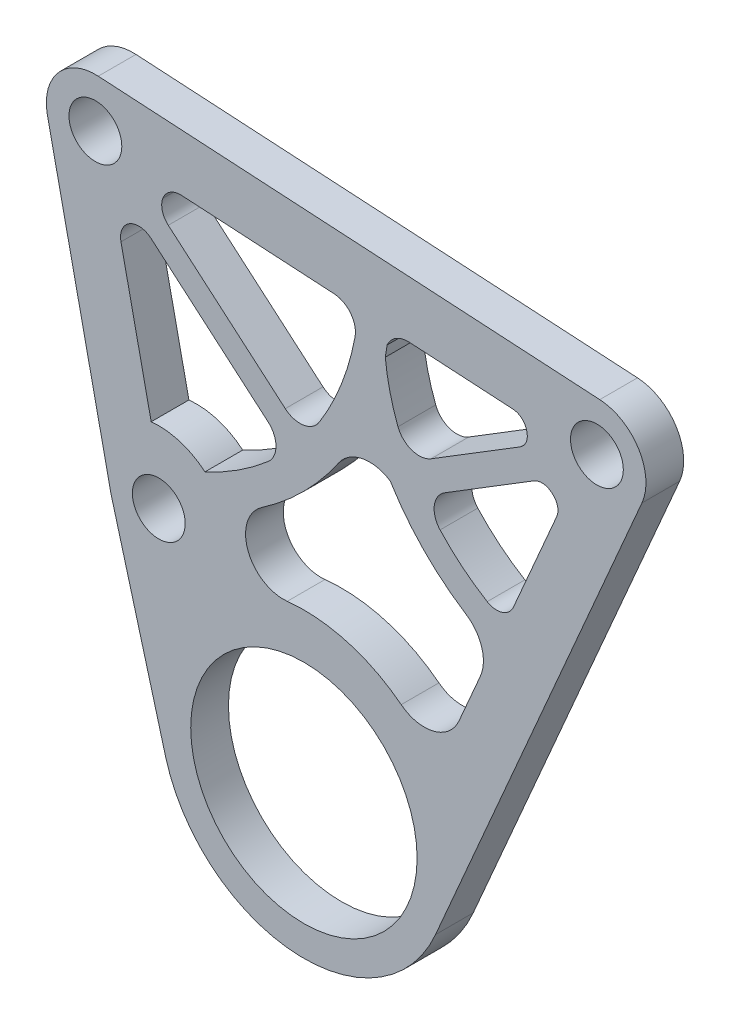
ISO-10303-21;
HEADER;
FILE_DESCRIPTION(('STEP AP214'),'2;1');
FILE_NAME('part.step','',(''),(''),'','','');
FILE_SCHEMA(('AUTOMOTIVE_DESIGN { 1 0 10303 214 1 1 1 1 }'));
ENDSEC;
DATA;
#1=APPLICATION_CONTEXT('core data for automotive mechanical design processes');
#2=APPLICATION_PROTOCOL_DEFINITION('international standard','automotive_design',2000,#1);
#3=PRODUCT_CONTEXT('',#1,'mechanical');
#4=PRODUCT('Part','Part','',(#3));
#5=PRODUCT_RELATED_PRODUCT_CATEGORY('part','',(#4));
#6=PRODUCT_DEFINITION_FORMATION('','',#4);
#7=PRODUCT_DEFINITION_CONTEXT('part definition',#1,'design');
#8=PRODUCT_DEFINITION('design','',#6,#7);
#9=PRODUCT_DEFINITION_SHAPE('','',#8);
#10=(LENGTH_UNIT() NAMED_UNIT(*) SI_UNIT(.MILLI.,.METRE.));
#11=(NAMED_UNIT(*) PLANE_ANGLE_UNIT() SI_UNIT($,.RADIAN.));
#12=(NAMED_UNIT(*) SI_UNIT($,.STERADIAN.) SOLID_ANGLE_UNIT());
#13=UNCERTAINTY_MEASURE_WITH_UNIT(LENGTH_MEASURE(1.E-05),#10,'distance_accuracy_value','');
#14=(GEOMETRIC_REPRESENTATION_CONTEXT(3) GLOBAL_UNCERTAINTY_ASSIGNED_CONTEXT((#13)) GLOBAL_UNIT_ASSIGNED_CONTEXT((#10,
#11,#12)) REPRESENTATION_CONTEXT('',''));
#15=CARTESIAN_POINT('',(0.,0.,0.));
#16=DIRECTION('',(0.,0.,1.));
#17=DIRECTION('',(1.,0.,0.));
#18=AXIS2_PLACEMENT_3D('',#15,#16,#17);
#19=CARTESIAN_POINT('',(0.,0.,5.));
#20=DIRECTION('',(0.,0.,1.));
#21=DIRECTION('',(1.,0.,0.));
#22=AXIS2_PLACEMENT_3D('',#19,#20,#21);
#23=PLANE('',#22);
#24=DIRECTION('',(-0.397143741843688,-0.917756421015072,0.));
#25=VECTOR('',#24,1.);
#26=CARTESIAN_POINT('',(10.5541988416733,-4.56715303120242,5.));
#27=LINE('',#26,#25);
#28=CARTESIAN_POINT('',(33.4984179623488,48.4544666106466,5.));
#29=VERTEX_POINT('',#28);
#30=CARTESIAN_POINT('',(27.7669426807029,35.209644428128,5.));
#31=VERTEX_POINT('',#30);
#32=EDGE_CURVE('E665',#29,#31,#27,.T.);
#33=ORIENTED_EDGE('',*,*,#32,.T.);
#34=CARTESIAN_POINT('',(25.5393645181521,36.1735916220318,5.));
#35=DIRECTION('',(0.,0.,1.));
#36=DIRECTION('',(1.,0.,0.));
#37=AXIS2_PLACEMENT_3D('',#34,#35,#36);
#38=CIRCLE('',#37,2.42719975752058);
#39=CARTESIAN_POINT('',(24.2876492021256,34.0940466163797,5.));
#40=VERTEX_POINT('',#39);
#41=EDGE_CURVE('E661',#40,#31,#38,.T.);
#42=ORIENTED_EDGE('',*,*,#41,.F.);
#43=CARTESIAN_POINT('',(38.8251854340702,58.2460726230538,5.));
#44=DIRECTION('',(0.,0.,1.));
#45=DIRECTION('',(1.,0.,0.));
#46=AXIS2_PLACEMENT_3D('',#43,#44,#45);
#47=CIRCLE('',#46,28.1897201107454);
#48=CARTESIAN_POINT('',(18.040522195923,39.2024885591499,5.));
#49=VERTEX_POINT('',#48);
#50=EDGE_CURVE('E638',#49,#40,#47,.T.);
#51=ORIENTED_EDGE('',*,*,#50,.F.);
#52=CARTESIAN_POINT('',(20.2524629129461,41.2291405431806,5.));
#53=DIRECTION('',(0.,0.,1.));
#54=DIRECTION('',(1.,0.,0.));
#55=AXIS2_PLACEMENT_3D('',#52,#53,#54);
#56=CIRCLE('',#55,3.);
#57=CARTESIAN_POINT('',(18.6792725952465,43.7835626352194,5.));
#58=VERTEX_POINT('',#57);
#59=EDGE_CURVE('E679',#58,#49,#56,.T.);
#60=ORIENTED_EDGE('',*,*,#59,.F.);
#61=DIRECTION('',(-0.851474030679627,-0.524396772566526,0.));
#62=VECTOR('',#61,1.);
#63=CARTESIAN_POINT('',(-14.4131587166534,23.4029478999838,5.));
#64=LINE('',#63,#62);
#65=CARTESIAN_POINT('',(30.4861586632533,51.0550620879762,5.));
#66=VERTEX_POINT('',#65);
#67=EDGE_CURVE('E676',#66,#58,#64,.T.);
#68=ORIENTED_EDGE('',*,*,#67,.F.);
#69=CARTESIAN_POINT('',(31.5349522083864,49.3521140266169,5.));
#70=DIRECTION('',(0.,0.,1.));
#71=DIRECTION('',(1.,0.,0.));
#72=AXIS2_PLACEMENT_3D('',#69,#70,#71);
#73=CIRCLE('',#72,2.);
#74=CARTESIAN_POINT('',(32.8546380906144,50.8549211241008,5.));
#75=VERTEX_POINT('',#74);
#76=EDGE_CURVE('E673',#75,#66,#73,.T.);
#77=ORIENTED_EDGE('',*,*,#76,.F.);
#78=CARTESIAN_POINT('',(31.6629051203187,49.2487540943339,5.));
#79=DIRECTION('',(0.,0.,1.));
#80=DIRECTION('',(1.,0.,0.));
#81=AXIS2_PLACEMENT_3D('',#78,#79,#80);
#82=CIRCLE('',#81,1.99999999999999);
#83=EDGE_CURVE('E669',#29,#75,#82,.T.);
#84=ORIENTED_EDGE('',*,*,#83,.F.);
#85=EDGE_LOOP('',(#33,#42,#51,#60,#68,#77,#84));
#86=FACE_BOUND('',#85,.T.);
#87=DIRECTION('',(-0.851474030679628,-0.524396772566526,0.));
#88=VECTOR('',#87,1.);
#89=CARTESIAN_POINT('',(-16.2485474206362,26.3831070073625,5.));
#90=LINE('',#89,#88);
#91=CARTESIAN_POINT('',(28.6507699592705,54.0352211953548,5.));
#92=VERTEX_POINT('',#91);
#93=CARTESIAN_POINT('',(16.8438838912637,46.7637217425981,5.));
#94=VERTEX_POINT('',#93);
#95=EDGE_CURVE('E714',#92,#94,#90,.T.);
#96=ORIENTED_EDGE('',*,*,#95,.T.);
#97=CARTESIAN_POINT('',(15.2706935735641,49.318143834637,5.));
#98=DIRECTION('',(0.,0.,1.));
#99=DIRECTION('',(1.,0.,0.));
#100=AXIS2_PLACEMENT_3D('',#97,#98,#99);
#101=CIRCLE('',#100,3.);
#102=CARTESIAN_POINT('',(12.4654430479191,48.2548614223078,5.));
#103=VERTEX_POINT('',#102);
#104=EDGE_CURVE('E711',#103,#94,#101,.T.);
#105=ORIENTED_EDGE('',*,*,#104,.F.);
#106=CARTESIAN_POINT('',(38.8251854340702,58.2460726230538,5.));
#107=DIRECTION('',(0.,0.,1.));
#108=DIRECTION('',(1.,0.,0.));
#109=AXIS2_PLACEMENT_3D('',#106,#107,#108);
#110=CIRCLE('',#109,28.1897201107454);
#111=CARTESIAN_POINT('',(10.7808468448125,55.3868082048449,5.));
#112=VERTEX_POINT('',#111);
#113=EDGE_CURVE('E707',#112,#103,#110,.T.);
#114=ORIENTED_EDGE('',*,*,#113,.F.);
#115=CARTESIAN_POINT('',(-27.6312392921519,62.1330396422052,5.));
#116=DIRECTION('',(0.,0.,1.));
#117=DIRECTION('',(1.,0.,0.));
#118=AXIS2_PLACEMENT_3D('',#115,#116,#117);
#119=CIRCLE('',#118,39.);
#120=CARTESIAN_POINT('',(11.0173375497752,56.9092949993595,5.));
#121=VERTEX_POINT('',#120);
#122=EDGE_CURVE('E696',#112,#121,#119,.T.);
#123=ORIENTED_EDGE('',*,*,#122,.T.);
#124=CARTESIAN_POINT('',(13.7663817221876,55.7027184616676,5.));
#125=DIRECTION('',(0.,0.,1.));
#126=DIRECTION('',(1.,0.,0.));
#127=AXIS2_PLACEMENT_3D('',#124,#125,#126);
#128=CIRCLE('',#127,3.00217767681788);
#129=CARTESIAN_POINT('',(13.9416763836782,58.6997741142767,5.));
#130=VERTEX_POINT('',#129);
#131=EDGE_CURVE('E730',#130,#121,#128,.T.);
#132=ORIENTED_EDGE('',*,*,#131,.F.);
#133=DIRECTION('',(0.998293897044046,-0.0583891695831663,0.));
#134=VECTOR('',#133,1.);
#135=CARTESIAN_POINT('',(3.46911480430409,59.312303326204,5.));
#136=LINE('',#135,#134);
#137=CARTESIAN_POINT('',(27.6839354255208,57.8960037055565,5.));
#138=VERTEX_POINT('',#137);
#139=EDGE_CURVE('E726',#130,#138,#136,.T.);
#140=ORIENTED_EDGE('',*,*,#139,.T.);
#141=CARTESIAN_POINT('',(27.5671570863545,55.8994159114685,5.));
#142=DIRECTION('',(0.,0.,1.));
#143=DIRECTION('',(1.,0.,0.));
#144=AXIS2_PLACEMENT_3D('',#141,#142,#143);
#145=CIRCLE('',#144,2.);
#146=CARTESIAN_POINT('',(29.5378440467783,56.2405799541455,5.));
#147=VERTEX_POINT('',#146);
#148=EDGE_CURVE('E722',#147,#138,#145,.T.);
#149=ORIENTED_EDGE('',*,*,#148,.F.);
#150=CARTESIAN_POINT('',(27.6019764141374,55.7381692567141,5.));
#151=DIRECTION('',(0.,0.,1.));
#152=DIRECTION('',(1.,0.,0.));
#153=AXIS2_PLACEMENT_3D('',#150,#151,#152);
#154=CIRCLE('',#153,2.00000000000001);
#155=EDGE_CURVE('E718',#92,#147,#154,.T.);
#156=ORIENTED_EDGE('',*,*,#155,.F.);
#157=EDGE_LOOP('',(#96,#105,#114,#123,#132,#140,#149,#156));
#158=FACE_BOUND('',#157,.T.);
#159=CARTESIAN_POINT('',(-27.6312392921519,62.1330396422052,5.));
#160=DIRECTION('',(0.,0.,1.));
#161=DIRECTION('',(1.,0.,0.));
#162=AXIS2_PLACEMENT_3D('',#159,#160,#161);
#163=CIRCLE('',#162,35.);
#164=CARTESIAN_POINT('',(2.0255732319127,43.5461229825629,5.));
#165=VERTEX_POINT('',#164);
#166=CARTESIAN_POINT('',(6.77954879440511,55.7379115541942,5.));
#167=VERTEX_POINT('',#166);
#168=EDGE_CURVE('E768',#165,#167,#163,.T.);
#169=ORIENTED_EDGE('',*,*,#168,.F.);
#170=CARTESIAN_POINT('',(-0.516439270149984,45.1392872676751,5.));
#171=DIRECTION('',(0.,0.,1.));
#172=DIRECTION('',(1.,0.,0.));
#173=AXIS2_PLACEMENT_3D('',#170,#171,#172);
#174=CIRCLE('',#173,3.);
#175=CARTESIAN_POINT('',(-2.46928412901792,42.8619210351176,5.));
#176=VERTEX_POINT('',#175);
#177=EDGE_CURVE('E764',#176,#165,#174,.T.);
#178=ORIENTED_EDGE('',*,*,#177,.F.);
#179=DIRECTION('',(0.759122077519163,-0.65094828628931,0.));
#180=VECTOR('',#179,1.);
#181=CARTESIAN_POINT('',(20.1338658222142,23.4796870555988,5.));
#182=LINE('',#181,#180);
#183=CARTESIAN_POINT('',(-17.9730692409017,56.1564393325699,5.));
#184=VERTEX_POINT('',#183);
#185=EDGE_CURVE('E753',#184,#176,#182,.T.);
#186=ORIENTED_EDGE('',*,*,#185,.F.);
#187=CARTESIAN_POINT('',(-16.3456985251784,58.0542445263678,5.));
#188=DIRECTION('',(0.,0.,1.));
#189=DIRECTION('',(1.,0.,0.));
#190=AXIS2_PLACEMENT_3D('',#187,#188,#189);
#191=CIRCLE('',#190,2.5);
#192=CARTESIAN_POINT('',(-18.7088491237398,58.8700381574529,5.));
#193=VERTEX_POINT('',#192);
#194=EDGE_CURVE('E784',#193,#184,#191,.T.);
#195=ORIENTED_EDGE('',*,*,#194,.F.);
#196=CARTESIAN_POINT('',(-16.3769441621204,57.9688060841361,5.));
#197=DIRECTION('',(0.,0.,1.));
#198=DIRECTION('',(1.,0.,0.));
#199=AXIS2_PLACEMENT_3D('',#196,#197,#198);
#200=CIRCLE('',#199,2.5);
#201=CARTESIAN_POINT('',(-16.2309712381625,60.4645408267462,5.));
#202=VERTEX_POINT('',#201);
#203=EDGE_CURVE('E780',#202,#193,#200,.T.);
#204=ORIENTED_EDGE('',*,*,#203,.F.);
#205=DIRECTION('',(0.998293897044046,-0.0583891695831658,0.));
#206=VECTOR('',#205,1.);
#207=CARTESIAN_POINT('',(3.46911480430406,59.312303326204,5.));
#208=LINE('',#207,#206);
#209=CARTESIAN_POINT('',(4.00522018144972,59.2809470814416,5.));
#210=VERTEX_POINT('',#209);
#211=EDGE_CURVE('E776',#202,#210,#208,.T.);
#212=ORIENTED_EDGE('',*,*,#211,.T.);
#213=CARTESIAN_POINT('',(3.83005267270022,56.2860653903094,5.));
#214=DIRECTION('',(0.,0.,1.));
#215=DIRECTION('',(1.,0.,0.));
#216=AXIS2_PLACEMENT_3D('',#213,#214,#215);
#217=CIRCLE('',#216,3.);
#218=EDGE_CURVE('E772',#167,#210,#217,.T.);
#219=ORIENTED_EDGE('',*,*,#218,.F.);
#220=EDGE_LOOP('',(#169,#178,#186,#195,#204,#212,#219));
#221=FACE_BOUND('',#220,.T.);
#222=CARTESIAN_POINT('',(-19.2315731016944,23.0249125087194,5.));
#223=DIRECTION('',(0.,0.,1.));
#224=DIRECTION('',(1.,0.,0.));
#225=AXIS2_PLACEMENT_3D('',#222,#223,#224);
#226=CIRCLE('',#225,3.5);
#227=CARTESIAN_POINT('',(-15.7315731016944,23.0249125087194,5.));
#228=VERTEX_POINT('',#227);
#229=EDGE_CURVE('E860',#228,#228,#226,.T.);
#230=ORIENTED_EDGE('',*,*,#229,.F.);
#231=EDGE_LOOP('',(#230));
#232=FACE_BOUND('',#231,.T.);
#233=CARTESIAN_POINT('',(0.,0.,5.));
#234=DIRECTION('',(0.,0.,1.));
#235=DIRECTION('',(1.,0.,0.));
#236=AXIS2_PLACEMENT_3D('',#233,#234,#235);
#237=CIRCLE('',#236,15.);
#238=CARTESIAN_POINT('',(15.,0.,5.));
#239=VERTEX_POINT('',#238);
#240=EDGE_CURVE('E864',#239,#239,#237,.T.);
#241=ORIENTED_EDGE('',*,*,#240,.F.);
#242=EDGE_LOOP('',(#241));
#243=FACE_BOUND('',#242,.T.);
#244=DIRECTION('',(0.262964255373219,-0.964805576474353,0.));
#245=VECTOR('',#244,1.);
#246=CARTESIAN_POINT('',(-18.3313059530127,-4.99632085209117,5.));
#247=LINE('',#246,#245);
#248=CARTESIAN_POINT('',(-25.5028093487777,21.3156448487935,5.));
#249=VERTEX_POINT('',#248);
#250=CARTESIAN_POINT('',(-18.3313059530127,-4.99632085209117,5.));
#251=VERTEX_POINT('',#250);
#252=EDGE_CURVE('E869',#249,#251,#247,.T.);
#253=ORIENTED_EDGE('',*,*,#252,.T.);
#254=CARTESIAN_POINT('',(0.,0.,5.));
#255=DIRECTION('',(0.,0.,1.));
#256=DIRECTION('',(1.,0.,0.));
#257=AXIS2_PLACEMENT_3D('',#254,#255,#256);
#258=CIRCLE('',#257,19.);
#259=CARTESIAN_POINT('',(17.4373719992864,-7.54573109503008,5.));
#260=VERTEX_POINT('',#259);
#261=EDGE_CURVE('E873',#251,#260,#258,.T.);
#262=ORIENTED_EDGE('',*,*,#261,.T.);
#263=DIRECTION('',(-0.397143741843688,-0.917756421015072,0.));
#264=VECTOR('',#263,1.);
#265=CARTESIAN_POINT('',(17.4373719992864,-7.54573109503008,5.));
#266=LINE('',#265,#264);
#267=CARTESIAN_POINT('',(44.7906021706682,55.6646383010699,5.));
#268=VERTEX_POINT('',#267);
#269=EDGE_CURVE('E876',#268,#260,#266,.T.);
#270=ORIENTED_EDGE('',*,*,#269,.F.);
#271=CARTESIAN_POINT('',(38.8251854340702,58.2460726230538,5.));
#272=DIRECTION('',(0.,0.,1.));
#273=DIRECTION('',(1.,0.,0.));
#274=AXIS2_PLACEMENT_3D('',#271,#272,#273);
#275=CIRCLE('',#274,6.5);
#276=CARTESIAN_POINT('',(39.2047150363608,64.7349829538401,5.));
#277=VERTEX_POINT('',#276);
#278=EDGE_CURVE('E880',#268,#277,#275,.T.);
#279=ORIENTED_EDGE('',*,*,#278,.T.);
#280=DIRECTION('',(0.998293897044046,-0.0583891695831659,0.));
#281=VECTOR('',#280,1.);
#282=CARTESIAN_POINT('',(3.90703357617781,66.7995075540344,5.));
#283=LINE('',#282,#281);
#284=CARTESIAN_POINT('',(-27.2517096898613,68.6219499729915,5.));
#285=VERTEX_POINT('',#284);
#286=EDGE_CURVE('E883',#285,#277,#283,.T.);
#287=ORIENTED_EDGE('',*,*,#286,.F.);
#288=CARTESIAN_POINT('',(-27.6312392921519,62.1330396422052,5.));
#289=DIRECTION('',(0.,0.,1.));
#290=DIRECTION('',(1.,0.,0.));
#291=AXIS2_PLACEMENT_3D('',#288,#289,#290);
#292=CIRCLE('',#291,6.50000000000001);
#293=CARTESIAN_POINT('',(-33.9863099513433,60.7680938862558,5.));
#294=VERTEX_POINT('',#293);
#295=EDGE_CURVE('E887',#285,#294,#292,.T.);
#296=ORIENTED_EDGE('',*,*,#295,.T.);
#297=DIRECTION('',(0.209991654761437,-0.977703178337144,0.));
#298=VECTOR('',#297,1.);
#299=CARTESIAN_POINT('',(-20.0113653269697,-4.29805263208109,5.));
#300=LINE('',#299,#298);
#301=CARTESIAN_POINT('',(-25.5866437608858,21.6599667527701,5.));
#302=VERTEX_POINT('',#301);
#303=EDGE_CURVE('E890',#294,#302,#300,.T.);
#304=ORIENTED_EDGE('',*,*,#303,.T.);
#305=CARTESIAN_POINT('',(-19.2315731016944,23.0249125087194,5.));
#306=DIRECTION('',(0.,0.,1.));
#307=DIRECTION('',(1.,0.,0.));
#308=AXIS2_PLACEMENT_3D('',#305,#306,#307);
#309=CIRCLE('',#308,6.50000000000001);
#310=EDGE_CURVE('E893',#302,#249,#309,.T.);
#311=ORIENTED_EDGE('',*,*,#310,.T.);
#312=EDGE_LOOP('',(#253,#262,#270,#279,#287,#296,#304,#311));
#313=FACE_BOUND('',#312,.T.);
#314=CARTESIAN_POINT('',(-27.6312392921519,62.1330396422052,5.));
#315=DIRECTION('',(0.,0.,1.));
#316=DIRECTION('',(1.,0.,0.));
#317=AXIS2_PLACEMENT_3D('',#314,#315,#316);
#318=CIRCLE('',#317,3.5);
#319=CARTESIAN_POINT('',(-24.1312392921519,62.1330396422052,5.));
#320=VERTEX_POINT('',#319);
#321=EDGE_CURVE('E896',#320,#320,#318,.T.);
#322=ORIENTED_EDGE('',*,*,#321,.F.);
#323=EDGE_LOOP('',(#322));
#324=FACE_BOUND('',#323,.T.);
#325=CARTESIAN_POINT('',(38.8251854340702,58.2460726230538,5.));
#326=DIRECTION('',(0.,0.,1.));
#327=DIRECTION('',(1.,0.,0.));
#328=AXIS2_PLACEMENT_3D('',#325,#326,#327);
#329=CIRCLE('',#328,3.5);
#330=CARTESIAN_POINT('',(42.3251854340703,58.2460726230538,5.));
#331=VERTEX_POINT('',#330);
#332=EDGE_CURVE('E900',#331,#331,#329,.T.);
#333=ORIENTED_EDGE('',*,*,#332,.F.);
#334=EDGE_LOOP('',(#333));
#335=FACE_BOUND('',#334,.T.);
#336=CARTESIAN_POINT('',(-27.6312392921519,62.1330396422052,5.));
#337=DIRECTION('',(0.,0.,1.));
#338=DIRECTION('',(1.,0.,0.));
#339=AXIS2_PLACEMENT_3D('',#336,#337,#338);
#340=CIRCLE('',#339,35.);
#341=CARTESIAN_POINT('',(-13.1084061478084,30.288301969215,5.));
#342=VERTEX_POINT('',#341);
#343=CARTESIAN_POINT('',(-4.73818630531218,35.6583701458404,5.));
#344=VERTEX_POINT('',#343);
#345=EDGE_CURVE('E825',#342,#344,#340,.T.);
#346=ORIENTED_EDGE('',*,*,#345,.F.);
#347=CARTESIAN_POINT('',(-19.2315731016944,23.0249125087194,5.));
#348=DIRECTION('',(0.,0.,1.));
#349=DIRECTION('',(1.,0.,0.));
#350=AXIS2_PLACEMENT_3D('',#347,#348,#349);
#351=CIRCLE('',#350,9.5);
#352=CARTESIAN_POINT('',(-20.237707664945,32.4714829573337,5.));
#353=VERTEX_POINT('',#352);
#354=EDGE_CURVE('E821',#342,#353,#351,.T.);
#355=ORIENTED_EDGE('',*,*,#354,.T.);
#356=DIRECTION('',(0.209991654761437,-0.977703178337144,0.));
#357=VECTOR('',#356,1.);
#358=CARTESIAN_POINT('',(-24.2432014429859,51.1207192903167,5.));
#359=LINE('',#358,#357);
#360=CARTESIAN_POINT('',(-24.2432014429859,51.1207192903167,5.));
#361=VERTEX_POINT('',#360);
#362=EDGE_CURVE('E818',#361,#353,#359,.T.);
#363=ORIENTED_EDGE('',*,*,#362,.F.);
#364=CARTESIAN_POINT('',(-21.798943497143,51.6456984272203,5.));
#365=DIRECTION('',(0.,0.,1.));
#366=DIRECTION('',(1.,0.,0.));
#367=AXIS2_PLACEMENT_3D('',#364,#365,#366);
#368=CIRCLE('',#367,2.50000000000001);
#369=CARTESIAN_POINT('',(-23.0454069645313,53.8127999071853,5.));
#370=VERTEX_POINT('',#369);
#371=EDGE_CURVE('E815',#370,#361,#368,.T.);
#372=ORIENTED_EDGE('',*,*,#371,.F.);
#373=CARTESIAN_POINT('',(-21.8787589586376,51.6017068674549,5.));
#374=DIRECTION('',(0.,0.,1.));
#375=DIRECTION('',(1.,0.,0.));
#376=AXIS2_PLACEMENT_3D('',#373,#374,#375);
#377=CIRCLE('',#376,2.5);
#378=CARTESIAN_POINT('',(-20.2513882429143,53.4995120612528,5.));
#379=VERTEX_POINT('',#378);
#380=EDGE_CURVE('E806',#379,#370,#377,.T.);
#381=ORIENTED_EDGE('',*,*,#380,.F.);
#382=DIRECTION('',(0.759122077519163,-0.65094828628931,0.));
#383=VECTOR('',#382,1.);
#384=CARTESIAN_POINT('',(-20.2513882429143,53.4995120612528,5.));
#385=LINE('',#384,#383);
#386=CARTESIAN_POINT('',(-4.7476031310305,40.2049937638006,5.));
#387=VERTEX_POINT('',#386);
#388=EDGE_CURVE('E833',#379,#387,#385,.T.);
#389=ORIENTED_EDGE('',*,*,#388,.T.);
#390=CARTESIAN_POINT('',(-6.70044798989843,37.9276275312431,5.));
#391=DIRECTION('',(0.,0.,1.));
#392=DIRECTION('',(1.,0.,0.));
#393=AXIS2_PLACEMENT_3D('',#390,#391,#392);
#394=CIRCLE('',#393,3.);
#395=EDGE_CURVE('E829',#344,#387,#394,.T.);
#396=ORIENTED_EDGE('',*,*,#395,.F.);
#397=EDGE_LOOP('',(#346,#355,#363,#372,#381,#389,#396));
#398=FACE_BOUND('',#397,.T.);
#399=CARTESIAN_POINT('',(15.9632688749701,20.522525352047,5.));
#400=DIRECTION('',(0.,0.,1.));
#401=DIRECTION('',(1.,0.,0.));
#402=AXIS2_PLACEMENT_3D('',#399,#400,#401);
#403=CIRCLE('',#402,5.);
#404=CARTESIAN_POINT('',(12.8934094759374,16.5758858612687,5.));
#405=VERTEX_POINT('',#404);
#406=CARTESIAN_POINT('',(20.5520509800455,18.5368066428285,5.));
#407=VERTEX_POINT('',#406);
#408=EDGE_CURVE('E594',#405,#407,#403,.T.);
#409=ORIENTED_EDGE('',*,*,#408,.F.);
#410=CARTESIAN_POINT('',(0.,0.,5.));
#411=DIRECTION('',(0.,0.,1.));
#412=DIRECTION('',(1.,0.,0.));
#413=AXIS2_PLACEMENT_3D('',#410,#411,#412);
#414=CIRCLE('',#413,21.);
#415=CARTESIAN_POINT('',(-2.20644086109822,20.8837644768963,5.));
#416=VERTEX_POINT('',#415);
#417=EDGE_CURVE('E582',#405,#416,#414,.T.);
#418=ORIENTED_EDGE('',*,*,#417,.T.);
#419=CARTESIAN_POINT('',(-2.73178392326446,25.8560893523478,5.));
#420=DIRECTION('',(0.,0.,1.));
#421=DIRECTION('',(1.,0.,0.));
#422=AXIS2_PLACEMENT_3D('',#419,#420,#421);
#423=CIRCLE('',#422,5.);
#424=CARTESIAN_POINT('',(-5.56126748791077,29.9784700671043,5.));
#425=VERTEX_POINT('',#424);
#426=EDGE_CURVE('E632',#425,#416,#423,.T.);
#427=ORIENTED_EDGE('',*,*,#426,.F.);
#428=CARTESIAN_POINT('',(-27.6312392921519,62.1330396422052,5.));
#429=DIRECTION('',(0.,0.,1.));
#430=DIRECTION('',(1.,0.,0.));
#431=AXIS2_PLACEMENT_3D('',#428,#429,#430);
#432=CIRCLE('',#431,39.);
#433=CARTESIAN_POINT('',(4.57768484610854,40.142468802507,5.));
#434=VERTEX_POINT('',#433);
#435=EDGE_CURVE('E628',#425,#434,#432,.T.);
#436=ORIENTED_EDGE('',*,*,#435,.T.);
#437=CARTESIAN_POINT('',(8.70703409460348,37.3231648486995,5.));
#438=DIRECTION('',(0.,0.,1.));
#439=DIRECTION('',(1.,0.,0.));
#440=AXIS2_PLACEMENT_3D('',#437,#438,#439);
#441=CIRCLE('',#440,5.);
#442=CARTESIAN_POINT('',(11.4420471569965,41.5088193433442,5.));
#443=VERTEX_POINT('',#442);
#444=EDGE_CURVE('E624',#443,#434,#441,.T.);
#445=ORIENTED_EDGE('',*,*,#444,.F.);
#446=CARTESIAN_POINT('',(38.8251854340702,58.2460726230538,5.));
#447=DIRECTION('',(0.,0.,1.));
#448=DIRECTION('',(1.,0.,0.));
#449=AXIS2_PLACEMENT_3D('',#446,#447,#448);
#450=CIRCLE('',#449,32.0931754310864);
#451=CARTESIAN_POINT('',(21.4831479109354,31.2418943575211,5.));
#452=VERTEX_POINT('',#451);
#453=EDGE_CURVE('E620',#443,#452,#450,.T.);
#454=ORIENTED_EDGE('',*,*,#453,.T.);
#455=CARTESIAN_POINT('',(18.7813215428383,27.0347416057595,5.));
#456=DIRECTION('',(0.,0.,1.));
#457=DIRECTION('',(1.,0.,0.));
#458=AXIS2_PLACEMENT_3D('',#455,#456,#457);
#459=CIRCLE('',#458,5.);
#460=CARTESIAN_POINT('',(23.3701036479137,25.049022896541,5.));
#461=VERTEX_POINT('',#460);
#462=EDGE_CURVE('E614',#461,#452,#459,.T.);
#463=ORIENTED_EDGE('',*,*,#462,.F.);
#464=DIRECTION('',(-0.397143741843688,-0.917756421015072,0.));
#465=VECTOR('',#464,1.);
#466=CARTESIAN_POINT('',(10.5541988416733,-4.56715303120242,5.));
#467=LINE('',#466,#465);
#468=EDGE_CURVE('E610',#461,#407,#467,.T.);
#469=ORIENTED_EDGE('',*,*,#468,.T.);
#470=EDGE_LOOP('',(#409,#418,#427,#436,#445,#454,#463,#469));
#471=FACE_BOUND('',#470,.T.);
#472=ADVANCED_FACE('F317',(#86,#158,#221,#232,#243,#313,#324,#335,#398,#471),#23,.T.);
#473=CARTESIAN_POINT('',(0.,0.,0.));
#474=DIRECTION('',(0.,0.,1.));
#475=DIRECTION('',(1.,0.,0.));
#476=AXIS2_PLACEMENT_3D('',#473,#474,#475);
#477=PLANE('',#476);
#478=CARTESIAN_POINT('',(25.5393645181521,36.1735916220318,0.));
#479=DIRECTION('',(0.,0.,1.));
#480=DIRECTION('',(1.,0.,0.));
#481=AXIS2_PLACEMENT_3D('',#478,#479,#480);
#482=CIRCLE('',#481,2.42719975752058);
#483=CARTESIAN_POINT('',(24.2876492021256,34.0940466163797,0.));
#484=VERTEX_POINT('',#483);
#485=CARTESIAN_POINT('',(27.7669426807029,35.209644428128,0.));
#486=VERTEX_POINT('',#485);
#487=EDGE_CURVE('E1086',#484,#486,#482,.T.);
#488=ORIENTED_EDGE('',*,*,#487,.T.);
#489=DIRECTION('',(0.397143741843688,0.917756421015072,0.));
#490=VECTOR('',#489,1.);
#491=CARTESIAN_POINT('',(27.7669426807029,35.209644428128,0.));
#492=LINE('',#491,#490);
#493=CARTESIAN_POINT('',(33.4984179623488,48.4544666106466,0.));
#494=VERTEX_POINT('',#493);
#495=EDGE_CURVE('E12',#486,#494,#492,.T.);
#496=ORIENTED_EDGE('',*,*,#495,.T.);
#497=CARTESIAN_POINT('',(31.6629051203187,49.2487540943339,0.));
#498=DIRECTION('',(0.,0.,1.));
#499=DIRECTION('',(1.,0.,0.));
#500=AXIS2_PLACEMENT_3D('',#497,#498,#499);
#501=CIRCLE('',#500,1.99999999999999);
#502=CARTESIAN_POINT('',(32.8546380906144,50.8549211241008,0.));
#503=VERTEX_POINT('',#502);
#504=EDGE_CURVE('E327',#494,#503,#501,.T.);
#505=ORIENTED_EDGE('',*,*,#504,.T.);
#506=CARTESIAN_POINT('',(31.5349522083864,49.3521140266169,0.));
#507=DIRECTION('',(0.,0.,1.));
#508=DIRECTION('',(1.,0.,0.));
#509=AXIS2_PLACEMENT_3D('',#506,#507,#508);
#510=CIRCLE('',#509,2.);
#511=CARTESIAN_POINT('',(30.4861586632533,51.0550620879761,0.));
#512=VERTEX_POINT('',#511);
#513=EDGE_CURVE('E1073',#503,#512,#510,.T.);
#514=ORIENTED_EDGE('',*,*,#513,.T.);
#515=DIRECTION('',(0.851474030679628,0.524396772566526,0.));
#516=VECTOR('',#515,1.);
#517=CARTESIAN_POINT('',(-14.4131587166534,23.4029478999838,0.));
#518=LINE('',#517,#516);
#519=CARTESIAN_POINT('',(18.6792725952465,43.7835626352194,0.));
#520=VERTEX_POINT('',#519);
#521=EDGE_CURVE('E1078',#520,#512,#518,.T.);
#522=ORIENTED_EDGE('',*,*,#521,.F.);
#523=CARTESIAN_POINT('',(20.2524629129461,41.2291405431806,0.));
#524=DIRECTION('',(0.,0.,1.));
#525=DIRECTION('',(1.,0.,0.));
#526=AXIS2_PLACEMENT_3D('',#523,#524,#525);
#527=CIRCLE('',#526,3.);
#528=CARTESIAN_POINT('',(18.040522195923,39.2024885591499,0.));
#529=VERTEX_POINT('',#528);
#530=EDGE_CURVE('E1077',#520,#529,#527,.T.);
#531=ORIENTED_EDGE('',*,*,#530,.T.);
#532=CARTESIAN_POINT('',(38.8251854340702,58.2460726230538,0.));
#533=DIRECTION('',(0.,0.,1.));
#534=DIRECTION('',(1.,0.,0.));
#535=AXIS2_PLACEMENT_3D('',#532,#533,#534);
#536=CIRCLE('',#535,28.1897201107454);
#537=EDGE_CURVE('E1082',#529,#484,#536,.T.);
#538=ORIENTED_EDGE('',*,*,#537,.T.);
#539=EDGE_LOOP('',(#488,#496,#505,#514,#522,#531,#538));
#540=FACE_BOUND('',#539,.T.);
#541=CARTESIAN_POINT('',(15.2706935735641,49.318143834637,0.));
#542=DIRECTION('',(0.,0.,1.));
#543=DIRECTION('',(1.,0.,0.));
#544=AXIS2_PLACEMENT_3D('',#541,#542,#543);
#545=CIRCLE('',#544,3.);
#546=CARTESIAN_POINT('',(12.4654430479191,48.2548614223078,0.));
#547=VERTEX_POINT('',#546);
#548=CARTESIAN_POINT('',(16.8438838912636,46.7637217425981,0.));
#549=VERTEX_POINT('',#548);
#550=EDGE_CURVE('E1064',#547,#549,#545,.T.);
#551=ORIENTED_EDGE('',*,*,#550,.T.);
#552=DIRECTION('',(0.851474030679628,0.524396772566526,0.));
#553=VECTOR('',#552,1.);
#554=CARTESIAN_POINT('',(16.8438838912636,46.7637217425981,0.));
#555=LINE('',#554,#553);
#556=CARTESIAN_POINT('',(28.6507699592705,54.0352211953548,0.));
#557=VERTEX_POINT('',#556);
#558=EDGE_CURVE('E1072',#549,#557,#555,.T.);
#559=ORIENTED_EDGE('',*,*,#558,.T.);
#560=CARTESIAN_POINT('',(27.6019764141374,55.7381692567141,0.));
#561=DIRECTION('',(0.,0.,1.));
#562=DIRECTION('',(1.,0.,0.));
#563=AXIS2_PLACEMENT_3D('',#560,#561,#562);
#564=CIRCLE('',#563,2.00000000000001);
#565=CARTESIAN_POINT('',(29.5378440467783,56.2405799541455,0.));
#566=VERTEX_POINT('',#565);
#567=EDGE_CURVE('E1068',#557,#566,#564,.T.);
#568=ORIENTED_EDGE('',*,*,#567,.T.);
#569=CARTESIAN_POINT('',(27.5671570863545,55.8994159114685,0.));
#570=DIRECTION('',(0.,0.,1.));
#571=DIRECTION('',(1.,0.,0.));
#572=AXIS2_PLACEMENT_3D('',#569,#570,#571);
#573=CIRCLE('',#572,2.);
#574=CARTESIAN_POINT('',(27.6839354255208,57.8960037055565,0.));
#575=VERTEX_POINT('',#574);
#576=EDGE_CURVE('E1049',#566,#575,#573,.T.);
#577=ORIENTED_EDGE('',*,*,#576,.T.);
#578=DIRECTION('',(-0.998293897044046,0.0583891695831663,0.));
#579=VECTOR('',#578,1.);
#580=CARTESIAN_POINT('',(27.6839354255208,57.8960037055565,0.));
#581=LINE('',#580,#579);
#582=CARTESIAN_POINT('',(13.9416763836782,58.6997741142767,0.));
#583=VERTEX_POINT('',#582);
#584=EDGE_CURVE('E1048',#575,#583,#581,.T.);
#585=ORIENTED_EDGE('',*,*,#584,.T.);
#586=CARTESIAN_POINT('',(13.7663817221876,55.7027184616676,0.));
#587=DIRECTION('',(0.,0.,1.));
#588=DIRECTION('',(1.,0.,0.));
#589=AXIS2_PLACEMENT_3D('',#586,#587,#588);
#590=CIRCLE('',#589,3.00217767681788);
#591=CARTESIAN_POINT('',(11.0173375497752,56.9092949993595,0.));
#592=VERTEX_POINT('',#591);
#593=EDGE_CURVE('E1053',#583,#592,#590,.T.);
#594=ORIENTED_EDGE('',*,*,#593,.T.);
#595=CARTESIAN_POINT('',(-27.6312392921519,62.1330396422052,0.));
#596=DIRECTION('',(0.,0.,1.));
#597=DIRECTION('',(1.,0.,0.));
#598=AXIS2_PLACEMENT_3D('',#595,#596,#597);
#599=CIRCLE('',#598,39.);
#600=CARTESIAN_POINT('',(10.7808468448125,55.3868082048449,0.));
#601=VERTEX_POINT('',#600);
#602=EDGE_CURVE('E1057',#601,#592,#599,.T.);
#603=ORIENTED_EDGE('',*,*,#602,.F.);
#604=CARTESIAN_POINT('',(38.8251854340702,58.2460726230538,0.));
#605=DIRECTION('',(0.,0.,1.));
#606=DIRECTION('',(1.,0.,0.));
#607=AXIS2_PLACEMENT_3D('',#604,#605,#606);
#608=CIRCLE('',#607,28.1897201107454);
#609=EDGE_CURVE('E1060',#601,#547,#608,.T.);
#610=ORIENTED_EDGE('',*,*,#609,.T.);
#611=EDGE_LOOP('',(#551,#559,#568,#577,#585,#594,#603,#610));
#612=FACE_BOUND('',#611,.T.);
#613=CARTESIAN_POINT('',(-19.2315731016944,23.0249125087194,0.));
#614=DIRECTION('',(0.,0.,1.));
#615=DIRECTION('',(1.,0.,0.));
#616=AXIS2_PLACEMENT_3D('',#613,#614,#615);
#617=CIRCLE('',#616,9.5);
#618=CARTESIAN_POINT('',(-13.1084061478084,30.288301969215,0.));
#619=VERTEX_POINT('',#618);
#620=CARTESIAN_POINT('',(-20.2377076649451,32.4714829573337,0.));
#621=VERTEX_POINT('',#620);
#622=EDGE_CURVE('E993',#619,#621,#617,.T.);
#623=ORIENTED_EDGE('',*,*,#622,.F.);
#624=CARTESIAN_POINT('',(-27.6312392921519,62.1330396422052,0.));
#625=DIRECTION('',(0.,0.,1.));
#626=DIRECTION('',(1.,0.,0.));
#627=AXIS2_PLACEMENT_3D('',#624,#625,#626);
#628=CIRCLE('',#627,35.);
#629=CARTESIAN_POINT('',(-4.73818630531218,35.6583701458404,0.));
#630=VERTEX_POINT('',#629);
#631=EDGE_CURVE('E988',#619,#630,#628,.T.);
#632=ORIENTED_EDGE('',*,*,#631,.T.);
#633=CARTESIAN_POINT('',(-6.70044798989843,37.9276275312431,0.));
#634=DIRECTION('',(0.,0.,1.));
#635=DIRECTION('',(1.,0.,0.));
#636=AXIS2_PLACEMENT_3D('',#633,#634,#635);
#637=CIRCLE('',#636,3.);
#638=CARTESIAN_POINT('',(-4.74760313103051,40.2049937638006,0.));
#639=VERTEX_POINT('',#638);
#640=EDGE_CURVE('E976',#630,#639,#637,.T.);
#641=ORIENTED_EDGE('',*,*,#640,.T.);
#642=DIRECTION('',(-0.759122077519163,0.65094828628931,0.));
#643=VECTOR('',#642,1.);
#644=CARTESIAN_POINT('',(-4.7476031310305,40.2049937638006,0.));
#645=LINE('',#644,#643);
#646=CARTESIAN_POINT('',(-20.2513882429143,53.4995120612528,0.));
#647=VERTEX_POINT('',#646);
#648=EDGE_CURVE('E975',#639,#647,#645,.T.);
#649=ORIENTED_EDGE('',*,*,#648,.T.);
#650=CARTESIAN_POINT('',(-21.8787589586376,51.6017068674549,0.));
#651=DIRECTION('',(0.,0.,1.));
#652=DIRECTION('',(1.,0.,0.));
#653=AXIS2_PLACEMENT_3D('',#650,#651,#652);
#654=CIRCLE('',#653,2.5);
#655=CARTESIAN_POINT('',(-23.0454069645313,53.8127999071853,0.));
#656=VERTEX_POINT('',#655);
#657=EDGE_CURVE('E980',#647,#656,#654,.T.);
#658=ORIENTED_EDGE('',*,*,#657,.T.);
#659=CARTESIAN_POINT('',(-21.798943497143,51.6456984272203,0.));
#660=DIRECTION('',(0.,0.,1.));
#661=DIRECTION('',(1.,0.,0.));
#662=AXIS2_PLACEMENT_3D('',#659,#660,#661);
#663=CIRCLE('',#662,2.50000000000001);
#664=CARTESIAN_POINT('',(-24.2432014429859,51.1207192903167,0.));
#665=VERTEX_POINT('',#664);
#666=EDGE_CURVE('E984',#656,#665,#663,.T.);
#667=ORIENTED_EDGE('',*,*,#666,.T.);
#668=DIRECTION('',(-0.209991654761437,0.977703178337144,0.));
#669=VECTOR('',#668,1.);
#670=CARTESIAN_POINT('',(-24.2432014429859,51.1207192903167,0.));
#671=LINE('',#670,#669);
#672=EDGE_CURVE('E992',#621,#665,#671,.T.);
#673=ORIENTED_EDGE('',*,*,#672,.F.);
#674=EDGE_LOOP('',(#623,#632,#641,#649,#658,#667,#673));
#675=FACE_BOUND('',#674,.T.);
#676=CARTESIAN_POINT('',(-19.2315731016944,23.0249125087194,0.));
#677=DIRECTION('',(0.,0.,1.));
#678=DIRECTION('',(1.,0.,0.));
#679=AXIS2_PLACEMENT_3D('',#676,#677,#678);
#680=CIRCLE('',#679,3.5);
#681=CARTESIAN_POINT('',(-15.7315731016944,23.0249125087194,0.));
#682=VERTEX_POINT('',#681);
#683=EDGE_CURVE('E854',#682,#682,#680,.T.);
#684=ORIENTED_EDGE('',*,*,#683,.T.);
#685=EDGE_LOOP('',(#684));
#686=FACE_BOUND('',#685,.T.);
#687=CARTESIAN_POINT('',(0.,0.,0.));
#688=DIRECTION('',(0.,0.,1.));
#689=DIRECTION('',(1.,0.,0.));
#690=AXIS2_PLACEMENT_3D('',#687,#688,#689);
#691=CIRCLE('',#690,15.);
#692=CARTESIAN_POINT('',(15.,0.,0.));
#693=VERTEX_POINT('',#692);
#694=EDGE_CURVE('E908',#693,#693,#691,.T.);
#695=ORIENTED_EDGE('',*,*,#694,.T.);
#696=EDGE_LOOP('',(#695));
#697=FACE_BOUND('',#696,.T.);
#698=DIRECTION('',(0.262964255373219,-0.964805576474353,0.));
#699=VECTOR('',#698,1.);
#700=CARTESIAN_POINT('',(-18.3313059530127,-4.99632085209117,0.));
#701=LINE('',#700,#699);
#702=CARTESIAN_POINT('',(-25.5028093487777,21.3156448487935,0.));
#703=VERTEX_POINT('',#702);
#704=CARTESIAN_POINT('',(-18.3313059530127,-4.99632085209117,0.));
#705=VERTEX_POINT('',#704);
#706=EDGE_CURVE('E912',#703,#705,#701,.T.);
#707=ORIENTED_EDGE('',*,*,#706,.F.);
#708=CARTESIAN_POINT('',(-19.2315731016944,23.0249125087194,0.));
#709=DIRECTION('',(0.,0.,1.));
#710=DIRECTION('',(1.,0.,0.));
#711=AXIS2_PLACEMENT_3D('',#708,#709,#710);
#712=CIRCLE('',#711,6.50000000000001);
#713=CARTESIAN_POINT('',(-25.5866437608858,21.6599667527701,0.));
#714=VERTEX_POINT('',#713);
#715=EDGE_CURVE('E938',#714,#703,#712,.T.);
#716=ORIENTED_EDGE('',*,*,#715,.F.);
#717=DIRECTION('',(0.209991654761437,-0.977703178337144,0.));
#718=VECTOR('',#717,1.);
#719=CARTESIAN_POINT('',(-20.0113653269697,-4.29805263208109,0.));
#720=LINE('',#719,#718);
#721=CARTESIAN_POINT('',(-33.9863099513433,60.7680938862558,0.));
#722=VERTEX_POINT('',#721);
#723=EDGE_CURVE('E935',#722,#714,#720,.T.);
#724=ORIENTED_EDGE('',*,*,#723,.F.);
#725=CARTESIAN_POINT('',(-27.6312392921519,62.1330396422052,0.));
#726=DIRECTION('',(0.,0.,1.));
#727=DIRECTION('',(1.,0.,0.));
#728=AXIS2_PLACEMENT_3D('',#725,#726,#727);
#729=CIRCLE('',#728,6.50000000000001);
#730=CARTESIAN_POINT('',(-27.2517096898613,68.6219499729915,0.));
#731=VERTEX_POINT('',#730);
#732=EDGE_CURVE('E932',#731,#722,#729,.T.);
#733=ORIENTED_EDGE('',*,*,#732,.F.);
#734=DIRECTION('',(0.998293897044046,-0.0583891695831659,0.));
#735=VECTOR('',#734,1.);
#736=CARTESIAN_POINT('',(3.90703357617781,66.7995075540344,0.));
#737=LINE('',#736,#735);
#738=CARTESIAN_POINT('',(39.2047150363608,64.7349829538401,0.));
#739=VERTEX_POINT('',#738);
#740=EDGE_CURVE('E928',#731,#739,#737,.T.);
#741=ORIENTED_EDGE('',*,*,#740,.T.);
#742=CARTESIAN_POINT('',(38.8251854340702,58.2460726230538,0.));
#743=DIRECTION('',(0.,0.,1.));
#744=DIRECTION('',(1.,0.,0.));
#745=AXIS2_PLACEMENT_3D('',#742,#743,#744);
#746=CIRCLE('',#745,6.5);
#747=CARTESIAN_POINT('',(44.7906021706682,55.6646383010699,0.));
#748=VERTEX_POINT('',#747);
#749=EDGE_CURVE('E924',#748,#739,#746,.T.);
#750=ORIENTED_EDGE('',*,*,#749,.F.);
#751=DIRECTION('',(-0.397143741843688,-0.917756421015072,0.));
#752=VECTOR('',#751,1.);
#753=CARTESIAN_POINT('',(17.4373719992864,-7.54573109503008,0.));
#754=LINE('',#753,#752);
#755=CARTESIAN_POINT('',(17.4373719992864,-7.54573109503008,0.));
#756=VERTEX_POINT('',#755);
#757=EDGE_CURVE('E920',#748,#756,#754,.T.);
#758=ORIENTED_EDGE('',*,*,#757,.T.);
#759=CARTESIAN_POINT('',(0.,0.,0.));
#760=DIRECTION('',(0.,0.,1.));
#761=DIRECTION('',(1.,0.,0.));
#762=AXIS2_PLACEMENT_3D('',#759,#760,#761);
#763=CIRCLE('',#762,19.);
#764=EDGE_CURVE('E916',#705,#756,#763,.T.);
#765=ORIENTED_EDGE('',*,*,#764,.F.);
#766=EDGE_LOOP('',(#707,#716,#724,#733,#741,#750,#758,#765));
#767=FACE_BOUND('',#766,.T.);
#768=CARTESIAN_POINT('',(-27.6312392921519,62.1330396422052,0.));
#769=DIRECTION('',(0.,0.,1.));
#770=DIRECTION('',(1.,0.,0.));
#771=AXIS2_PLACEMENT_3D('',#768,#769,#770);
#772=CIRCLE('',#771,3.5);
#773=CARTESIAN_POINT('',(-24.1312392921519,62.1330396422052,0.));
#774=VERTEX_POINT('',#773);
#775=EDGE_CURVE('E941',#774,#774,#772,.T.);
#776=ORIENTED_EDGE('',*,*,#775,.T.);
#777=EDGE_LOOP('',(#776));
#778=FACE_BOUND('',#777,.T.);
#779=CARTESIAN_POINT('',(38.8251854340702,58.2460726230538,0.));
#780=DIRECTION('',(0.,0.,1.));
#781=DIRECTION('',(1.,0.,0.));
#782=AXIS2_PLACEMENT_3D('',#779,#780,#781);
#783=CIRCLE('',#782,3.5);
#784=CARTESIAN_POINT('',(42.3251854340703,58.2460726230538,0.));
#785=VERTEX_POINT('',#784);
#786=EDGE_CURVE('E865',#785,#785,#783,.T.);
#787=ORIENTED_EDGE('',*,*,#786,.T.);
#788=EDGE_LOOP('',(#787));
#789=FACE_BOUND('',#788,.T.);
#790=CARTESIAN_POINT('',(-0.516439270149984,45.1392872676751,0.));
#791=DIRECTION('',(0.,0.,1.));
#792=DIRECTION('',(1.,0.,0.));
#793=AXIS2_PLACEMENT_3D('',#790,#791,#792);
#794=CIRCLE('',#793,3.);
#795=CARTESIAN_POINT('',(-2.46928412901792,42.8619210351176,0.));
#796=VERTEX_POINT('',#795);
#797=CARTESIAN_POINT('',(2.0255732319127,43.5461229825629,0.));
#798=VERTEX_POINT('',#797);
#799=EDGE_CURVE('E1016',#796,#798,#794,.T.);
#800=ORIENTED_EDGE('',*,*,#799,.T.);
#801=CARTESIAN_POINT('',(-27.6312392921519,62.1330396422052,0.));
#802=DIRECTION('',(0.,0.,1.));
#803=DIRECTION('',(1.,0.,0.));
#804=AXIS2_PLACEMENT_3D('',#801,#802,#803);
#805=CIRCLE('',#804,35.);
#806=CARTESIAN_POINT('',(6.77954879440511,55.7379115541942,0.));
#807=VERTEX_POINT('',#806);
#808=EDGE_CURVE('E1020',#798,#807,#805,.T.);
#809=ORIENTED_EDGE('',*,*,#808,.T.);
#810=CARTESIAN_POINT('',(3.83005267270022,56.2860653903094,0.));
#811=DIRECTION('',(0.,0.,1.));
#812=DIRECTION('',(1.,0.,0.));
#813=AXIS2_PLACEMENT_3D('',#810,#811,#812);
#814=CIRCLE('',#813,3.);
#815=CARTESIAN_POINT('',(4.00522018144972,59.2809470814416,0.));
#816=VERTEX_POINT('',#815);
#817=EDGE_CURVE('E1003',#807,#816,#814,.T.);
#818=ORIENTED_EDGE('',*,*,#817,.T.);
#819=DIRECTION('',(-0.998293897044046,0.0583891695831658,0.));
#820=VECTOR('',#819,1.);
#821=CARTESIAN_POINT('',(4.00522018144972,59.2809470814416,0.));
#822=LINE('',#821,#820);
#823=CARTESIAN_POINT('',(-16.2309712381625,60.4645408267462,0.));
#824=VERTEX_POINT('',#823);
#825=EDGE_CURVE('E996',#816,#824,#822,.T.);
#826=ORIENTED_EDGE('',*,*,#825,.T.);
#827=CARTESIAN_POINT('',(-16.3769441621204,57.9688060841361,0.));
#828=DIRECTION('',(0.,0.,1.));
#829=DIRECTION('',(1.,0.,0.));
#830=AXIS2_PLACEMENT_3D('',#827,#828,#829);
#831=CIRCLE('',#830,2.5);
#832=CARTESIAN_POINT('',(-18.7088491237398,58.8700381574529,0.));
#833=VERTEX_POINT('',#832);
#834=EDGE_CURVE('E1007',#824,#833,#831,.T.);
#835=ORIENTED_EDGE('',*,*,#834,.T.);
#836=CARTESIAN_POINT('',(-16.3456985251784,58.0542445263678,0.));
#837=DIRECTION('',(0.,0.,1.));
#838=DIRECTION('',(1.,0.,0.));
#839=AXIS2_PLACEMENT_3D('',#836,#837,#838);
#840=CIRCLE('',#839,2.5);
#841=CARTESIAN_POINT('',(-17.9730692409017,56.1564393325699,0.));
#842=VERTEX_POINT('',#841);
#843=EDGE_CURVE('E1011',#833,#842,#840,.T.);
#844=ORIENTED_EDGE('',*,*,#843,.T.);
#845=DIRECTION('',(-0.759122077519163,0.65094828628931,0.));
#846=VECTOR('',#845,1.);
#847=CARTESIAN_POINT('',(20.1338658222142,23.4796870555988,0.));
#848=LINE('',#847,#846);
#849=EDGE_CURVE('E1015',#796,#842,#848,.T.);
#850=ORIENTED_EDGE('',*,*,#849,.F.);
#851=EDGE_LOOP('',(#800,#809,#818,#826,#835,#844,#850));
#852=FACE_BOUND('',#851,.T.);
#853=CARTESIAN_POINT('',(0.,0.,0.));
#854=DIRECTION('',(0.,0.,1.));
#855=DIRECTION('',(1.,0.,0.));
#856=AXIS2_PLACEMENT_3D('',#853,#854,#855);
#857=CIRCLE('',#856,21.);
#858=CARTESIAN_POINT('',(12.8934094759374,16.5758858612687,0.));
#859=VERTEX_POINT('',#858);
#860=CARTESIAN_POINT('',(-2.20644086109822,20.8837644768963,0.));
#861=VERTEX_POINT('',#860);
#862=EDGE_CURVE('E1045',#859,#861,#857,.T.);
#863=ORIENTED_EDGE('',*,*,#862,.F.);
#864=CARTESIAN_POINT('',(15.9632688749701,20.522525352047,0.));
#865=DIRECTION('',(0.,0.,1.));
#866=DIRECTION('',(1.,0.,0.));
#867=AXIS2_PLACEMENT_3D('',#864,#865,#866);
#868=CIRCLE('',#867,5.);
#869=CARTESIAN_POINT('',(20.5520509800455,18.5368066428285,0.));
#870=VERTEX_POINT('',#869);
#871=EDGE_CURVE('E602',#859,#870,#868,.T.);
#872=ORIENTED_EDGE('',*,*,#871,.T.);
#873=DIRECTION('',(-0.397143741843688,-0.917756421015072,0.));
#874=VECTOR('',#873,1.);
#875=CARTESIAN_POINT('',(10.5541988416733,-4.56715303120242,0.));
#876=LINE('',#875,#874);
#877=CARTESIAN_POINT('',(23.3701036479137,25.049022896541,0.));
#878=VERTEX_POINT('',#877);
#879=EDGE_CURVE('E1026',#878,#870,#876,.T.);
#880=ORIENTED_EDGE('',*,*,#879,.F.);
#881=CARTESIAN_POINT('',(18.7813215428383,27.0347416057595,0.));
#882=DIRECTION('',(0.,0.,1.));
#883=DIRECTION('',(1.,0.,0.));
#884=AXIS2_PLACEMENT_3D('',#881,#882,#883);
#885=CIRCLE('',#884,5.);
#886=CARTESIAN_POINT('',(21.4831479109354,31.2418943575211,0.));
#887=VERTEX_POINT('',#886);
#888=EDGE_CURVE('E1027',#878,#887,#885,.T.);
#889=ORIENTED_EDGE('',*,*,#888,.T.);
#890=CARTESIAN_POINT('',(38.8251854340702,58.2460726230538,0.));
#891=DIRECTION('',(0.,0.,1.));
#892=DIRECTION('',(1.,0.,0.));
#893=AXIS2_PLACEMENT_3D('',#890,#891,#892);
#894=CIRCLE('',#893,32.0931754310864);
#895=CARTESIAN_POINT('',(11.4420471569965,41.5088193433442,0.));
#896=VERTEX_POINT('',#895);
#897=EDGE_CURVE('E1031',#896,#887,#894,.T.);
#898=ORIENTED_EDGE('',*,*,#897,.F.);
#899=CARTESIAN_POINT('',(8.70703409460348,37.3231648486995,0.));
#900=DIRECTION('',(0.,0.,1.));
#901=DIRECTION('',(1.,0.,0.));
#902=AXIS2_PLACEMENT_3D('',#899,#900,#901);
#903=CIRCLE('',#902,5.);
#904=CARTESIAN_POINT('',(4.57768484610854,40.142468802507,0.));
#905=VERTEX_POINT('',#904);
#906=EDGE_CURVE('E1034',#896,#905,#903,.T.);
#907=ORIENTED_EDGE('',*,*,#906,.T.);
#908=CARTESIAN_POINT('',(-27.6312392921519,62.1330396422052,0.));
#909=DIRECTION('',(0.,0.,1.));
#910=DIRECTION('',(1.,0.,0.));
#911=AXIS2_PLACEMENT_3D('',#908,#909,#910);
#912=CIRCLE('',#911,39.);
#913=CARTESIAN_POINT('',(-5.56126748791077,29.9784700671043,0.));
#914=VERTEX_POINT('',#913);
#915=EDGE_CURVE('E1038',#914,#905,#912,.T.);
#916=ORIENTED_EDGE('',*,*,#915,.F.);
#917=CARTESIAN_POINT('',(-2.73178392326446,25.8560893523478,0.));
#918=DIRECTION('',(0.,0.,1.));
#919=DIRECTION('',(1.,0.,0.));
#920=AXIS2_PLACEMENT_3D('',#917,#918,#919);
#921=CIRCLE('',#920,5.);
#922=EDGE_CURVE('E1041',#914,#861,#921,.T.);
#923=ORIENTED_EDGE('',*,*,#922,.T.);
#924=EDGE_LOOP('',(#863,#872,#880,#889,#898,#907,#916,#923));
#925=FACE_BOUND('',#924,.T.);
#926=ADVANCED_FACE('F1117',(#540,#612,#675,#686,#697,#767,#778,#789,#852,#925),#477,.F.);
#927=CARTESIAN_POINT('',(-18.3313059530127,-4.99632085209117,5.));
#928=DIRECTION('',(0.964805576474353,0.262964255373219,0.));
#929=DIRECTION('',(-0.262964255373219,0.964805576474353,0.));
#930=AXIS2_PLACEMENT_3D('',#927,#928,#929);
#931=PLANE('',#930);
#932=ORIENTED_EDGE('',*,*,#706,.T.);
#933=DIRECTION('',(0.,0.,-1.));
#934=VECTOR('',#933,1.);
#935=CARTESIAN_POINT('',(-18.3313059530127,-4.99632085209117,5.));
#936=LINE('',#935,#934);
#937=EDGE_CURVE('E971',#251,#705,#936,.T.);
#938=ORIENTED_EDGE('',*,*,#937,.F.);
#939=ORIENTED_EDGE('',*,*,#252,.F.);
#940=DIRECTION('',(0.,0.,-1.));
#941=VECTOR('',#940,1.);
#942=CARTESIAN_POINT('',(-25.5028093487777,21.3156448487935,5.));
#943=LINE('',#942,#941);
#944=EDGE_CURVE('E904',#249,#703,#943,.T.);
#945=ORIENTED_EDGE('',*,*,#944,.T.);
#946=EDGE_LOOP('',(#932,#938,#939,#945));
#947=FACE_BOUND('',#946,.T.);
#948=ADVANCED_FACE('F1183',(#947),#931,.F.);
#949=CARTESIAN_POINT('',(0.,0.,5.));
#950=DIRECTION('',(0.,0.,-1.));
#951=DIRECTION('',(-1.,0.,0.));
#952=AXIS2_PLACEMENT_3D('',#949,#950,#951);
#953=CYLINDRICAL_SURFACE('',#952,19.);
#954=ORIENTED_EDGE('',*,*,#764,.T.);
#955=DIRECTION('',(0.,0.,-1.));
#956=VECTOR('',#955,1.);
#957=CARTESIAN_POINT('',(17.4373719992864,-7.54573109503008,5.));
#958=LINE('',#957,#956);
#959=EDGE_CURVE('E968',#260,#756,#958,.T.);
#960=ORIENTED_EDGE('',*,*,#959,.F.);
#961=ORIENTED_EDGE('',*,*,#261,.F.);
#962=ORIENTED_EDGE('',*,*,#937,.T.);
#963=EDGE_LOOP('',(#954,#960,#961,#962));
#964=FACE_BOUND('',#963,.T.);
#965=ADVANCED_FACE('F1221',(#964),#953,.T.);
#966=CARTESIAN_POINT('',(17.4373719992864,-7.54573109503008,5.));
#967=DIRECTION('',(0.917756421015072,-0.397143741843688,0.));
#968=DIRECTION('',(0.397143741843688,0.917756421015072,0.));
#969=AXIS2_PLACEMENT_3D('',#966,#967,#968);
#970=PLANE('',#969);
#971=ORIENTED_EDGE('',*,*,#757,.F.);
#972=DIRECTION('',(0.,0.,-1.));
#973=VECTOR('',#972,1.);
#974=CARTESIAN_POINT('',(44.7906021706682,55.6646383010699,5.));
#975=LINE('',#974,#973);
#976=EDGE_CURVE('E965',#268,#748,#975,.T.);
#977=ORIENTED_EDGE('',*,*,#976,.F.);
#978=ORIENTED_EDGE('',*,*,#269,.T.);
#979=ORIENTED_EDGE('',*,*,#959,.T.);
#980=EDGE_LOOP('',(#971,#977,#978,#979));
#981=FACE_BOUND('',#980,.T.);
#982=ADVANCED_FACE('F1217',(#981),#970,.T.);
#983=CARTESIAN_POINT('',(38.8251854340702,58.2460726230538,5.));
#984=DIRECTION('',(0.,0.,-1.));
#985=DIRECTION('',(-1.,0.,0.));
#986=AXIS2_PLACEMENT_3D('',#983,#984,#985);
#987=CYLINDRICAL_SURFACE('',#986,6.5);
#988=ORIENTED_EDGE('',*,*,#749,.T.);
#989=DIRECTION('',(0.,0.,-1.));
#990=VECTOR('',#989,1.);
#991=CARTESIAN_POINT('',(39.2047150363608,64.7349829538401,5.));
#992=LINE('',#991,#990);
#993=EDGE_CURVE('E962',#277,#739,#992,.T.);
#994=ORIENTED_EDGE('',*,*,#993,.F.);
#995=ORIENTED_EDGE('',*,*,#278,.F.);
#996=ORIENTED_EDGE('',*,*,#976,.T.);
#997=EDGE_LOOP('',(#988,#994,#995,#996));
#998=FACE_BOUND('',#997,.T.);
#999=ADVANCED_FACE('F1213',(#998),#987,.T.);
#1000=CARTESIAN_POINT('',(3.90703357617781,66.7995075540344,5.));
#1001=DIRECTION('',(0.0583891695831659,0.998293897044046,0.));
#1002=DIRECTION('',(-0.998293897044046,0.0583891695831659,0.));
#1003=AXIS2_PLACEMENT_3D('',#1000,#1001,#1002);
#1004=PLANE('',#1003);
#1005=ORIENTED_EDGE('',*,*,#740,.F.);
#1006=DIRECTION('',(0.,0.,-1.));
#1007=VECTOR('',#1006,1.);
#1008=CARTESIAN_POINT('',(-27.2517096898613,68.6219499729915,5.));
#1009=LINE('',#1008,#1007);
#1010=EDGE_CURVE('E959',#285,#731,#1009,.T.);
#1011=ORIENTED_EDGE('',*,*,#1010,.F.);
#1012=ORIENTED_EDGE('',*,*,#286,.T.);
#1013=ORIENTED_EDGE('',*,*,#993,.T.);
#1014=EDGE_LOOP('',(#1005,#1011,#1012,#1013));
#1015=FACE_BOUND('',#1014,.T.);
#1016=ADVANCED_FACE('F1209',(#1015),#1004,.T.);
#1017=CARTESIAN_POINT('',(-27.6312392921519,62.1330396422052,5.));
#1018=DIRECTION('',(0.,0.,-1.));
#1019=DIRECTION('',(-1.,0.,0.));
#1020=AXIS2_PLACEMENT_3D('',#1017,#1018,#1019);
#1021=CYLINDRICAL_SURFACE('',#1020,6.50000000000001);
#1022=ORIENTED_EDGE('',*,*,#732,.T.);
#1023=DIRECTION('',(0.,0.,-1.));
#1024=VECTOR('',#1023,1.);
#1025=CARTESIAN_POINT('',(-33.9863099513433,60.7680938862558,5.));
#1026=LINE('',#1025,#1024);
#1027=EDGE_CURVE('E955',#294,#722,#1026,.T.);
#1028=ORIENTED_EDGE('',*,*,#1027,.F.);
#1029=ORIENTED_EDGE('',*,*,#295,.F.);
#1030=ORIENTED_EDGE('',*,*,#1010,.T.);
#1031=EDGE_LOOP('',(#1022,#1028,#1029,#1030));
#1032=FACE_BOUND('',#1031,.T.);
#1033=ADVANCED_FACE('F1205',(#1032),#1021,.T.);
#1034=CARTESIAN_POINT('',(-20.0113653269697,-4.29805263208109,5.));
#1035=DIRECTION('',(0.977703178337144,0.209991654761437,0.));
#1036=DIRECTION('',(-0.209991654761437,0.977703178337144,0.));
#1037=AXIS2_PLACEMENT_3D('',#1034,#1035,#1036);
#1038=PLANE('',#1037);
#1039=ORIENTED_EDGE('',*,*,#723,.T.);
#1040=DIRECTION('',(0.,0.,-1.));
#1041=VECTOR('',#1040,1.);
#1042=CARTESIAN_POINT('',(-25.5866437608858,21.6599667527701,5.));
#1043=LINE('',#1042,#1041);
#1044=EDGE_CURVE('E951',#302,#714,#1043,.T.);
#1045=ORIENTED_EDGE('',*,*,#1044,.F.);
#1046=ORIENTED_EDGE('',*,*,#303,.F.);
#1047=ORIENTED_EDGE('',*,*,#1027,.T.);
#1048=EDGE_LOOP('',(#1039,#1045,#1046,#1047));
#1049=FACE_BOUND('',#1048,.T.);
#1050=ADVANCED_FACE('F1197',(#1049),#1038,.F.);
#1051=CARTESIAN_POINT('',(-27.6312392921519,62.1330396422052,5.));
#1052=DIRECTION('',(0.,0.,-1.));
#1053=DIRECTION('',(-1.,0.,0.));
#1054=AXIS2_PLACEMENT_3D('',#1051,#1052,#1053);
#1055=CYLINDRICAL_SURFACE('',#1054,3.5);
#1056=ORIENTED_EDGE('',*,*,#321,.T.);
#1057=EDGE_LOOP('',(#1056));
#1058=FACE_BOUND('',#1057,.T.);
#1059=ORIENTED_EDGE('',*,*,#775,.F.);
#1060=EDGE_LOOP('',(#1059));
#1061=FACE_BOUND('',#1060,.T.);
#1062=ADVANCED_FACE('F1193',(#1058,#1061),#1055,.F.);
#1063=CARTESIAN_POINT('',(-19.2315731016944,23.0249125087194,5.));
#1064=DIRECTION('',(0.,0.,-1.));
#1065=DIRECTION('',(-1.,0.,0.));
#1066=AXIS2_PLACEMENT_3D('',#1063,#1064,#1065);
#1067=CYLINDRICAL_SURFACE('',#1066,6.50000000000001);
#1068=ORIENTED_EDGE('',*,*,#715,.T.);
#1069=ORIENTED_EDGE('',*,*,#944,.F.);
#1070=ORIENTED_EDGE('',*,*,#310,.F.);
#1071=ORIENTED_EDGE('',*,*,#1044,.T.);
#1072=EDGE_LOOP('',(#1068,#1069,#1070,#1071));
#1073=FACE_BOUND('',#1072,.T.);
#1074=ADVANCED_FACE('F1196',(#1073),#1067,.T.);
#1075=CARTESIAN_POINT('',(0.,0.,5.));
#1076=DIRECTION('',(0.,0.,-1.));
#1077=DIRECTION('',(-1.,0.,0.));
#1078=AXIS2_PLACEMENT_3D('',#1075,#1076,#1077);
#1079=CYLINDRICAL_SURFACE('',#1078,15.);
#1080=ORIENTED_EDGE('',*,*,#240,.T.);
#1081=EDGE_LOOP('',(#1080));
#1082=FACE_BOUND('',#1081,.T.);
#1083=ORIENTED_EDGE('',*,*,#694,.F.);
#1084=EDGE_LOOP('',(#1083));
#1085=FACE_BOUND('',#1084,.T.);
#1086=ADVANCED_FACE('F1201',(#1082,#1085),#1079,.F.);
#1087=CARTESIAN_POINT('',(-19.2315731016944,23.0249125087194,5.));
#1088=DIRECTION('',(0.,0.,-1.));
#1089=DIRECTION('',(-1.,0.,0.));
#1090=AXIS2_PLACEMENT_3D('',#1087,#1088,#1089);
#1091=CYLINDRICAL_SURFACE('',#1090,3.5);
#1092=ORIENTED_EDGE('',*,*,#229,.T.);
#1093=EDGE_LOOP('',(#1092));
#1094=FACE_BOUND('',#1093,.T.);
#1095=ORIENTED_EDGE('',*,*,#683,.F.);
#1096=EDGE_LOOP('',(#1095));
#1097=FACE_BOUND('',#1096,.T.);
#1098=ADVANCED_FACE('F319',(#1094,#1097),#1091,.F.);
#1099=CARTESIAN_POINT('',(38.8251854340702,58.2460726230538,5.));
#1100=DIRECTION('',(0.,0.,-1.));
#1101=DIRECTION('',(-1.,0.,0.));
#1102=AXIS2_PLACEMENT_3D('',#1099,#1100,#1101);
#1103=CYLINDRICAL_SURFACE('',#1102,3.5);
#1104=ORIENTED_EDGE('',*,*,#332,.T.);
#1105=EDGE_LOOP('',(#1104));
#1106=FACE_BOUND('',#1105,.T.);
#1107=ORIENTED_EDGE('',*,*,#786,.F.);
#1108=EDGE_LOOP('',(#1107));
#1109=FACE_BOUND('',#1108,.T.);
#1110=ADVANCED_FACE('F1189',(#1106,#1109),#1103,.F.);
#1111=CARTESIAN_POINT('',(-21.8787589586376,51.6017068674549,-1.2E-05));
#1112=DIRECTION('',(0.,0.,1.));
#1113=DIRECTION('',(1.,0.,0.));
#1114=AXIS2_PLACEMENT_3D('',#1111,#1112,#1113);
#1115=CYLINDRICAL_SURFACE('',#1114,2.5);
#1116=DIRECTION('',(0.,0.,-1.));
#1117=VECTOR('',#1116,1.);
#1118=CARTESIAN_POINT('',(-20.2513882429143,53.4995120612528,5.));
#1119=LINE('',#1118,#1117);
#1120=EDGE_CURVE('E837',#379,#647,#1119,.T.);
#1121=ORIENTED_EDGE('',*,*,#1120,.F.);
#1122=ORIENTED_EDGE('',*,*,#380,.T.);
#1123=DIRECTION('',(0.,0.,1.));
#1124=VECTOR('',#1123,1.);
#1125=CARTESIAN_POINT('',(-23.0454069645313,53.8127999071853,-1.2E-05));
#1126=LINE('',#1125,#1124);
#1127=EDGE_CURVE('E847',#656,#370,#1126,.T.);
#1128=ORIENTED_EDGE('',*,*,#1127,.F.);
#1129=ORIENTED_EDGE('',*,*,#657,.F.);
#1130=EDGE_LOOP('',(#1121,#1122,#1128,#1129));
#1131=FACE_BOUND('',#1130,.T.);
#1132=ADVANCED_FACE('F1186',(#1131),#1115,.F.);
#1133=CARTESIAN_POINT('',(-6.70044798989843,37.9276275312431,-1.2E-05));
#1134=DIRECTION('',(0.,0.,1.));
#1135=DIRECTION('',(1.,0.,0.));
#1136=AXIS2_PLACEMENT_3D('',#1133,#1134,#1135);
#1137=CYLINDRICAL_SURFACE('',#1136,3.);
#1138=DIRECTION('',(0.,0.,1.));
#1139=VECTOR('',#1138,1.);
#1140=CARTESIAN_POINT('',(-4.73818630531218,35.6583701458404,-1.2E-05));
#1141=LINE('',#1140,#1139);
#1142=EDGE_CURVE('E851',#630,#344,#1141,.T.);
#1143=ORIENTED_EDGE('',*,*,#1142,.T.);
#1144=ORIENTED_EDGE('',*,*,#395,.T.);
#1145=DIRECTION('',(0.,0.,-1.));
#1146=VECTOR('',#1145,1.);
#1147=CARTESIAN_POINT('',(-4.74760313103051,40.2049937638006,5.));
#1148=LINE('',#1147,#1146);
#1149=EDGE_CURVE('E840',#387,#639,#1148,.T.);
#1150=ORIENTED_EDGE('',*,*,#1149,.T.);
#1151=ORIENTED_EDGE('',*,*,#640,.F.);
#1152=EDGE_LOOP('',(#1143,#1144,#1150,#1151));
#1153=FACE_BOUND('',#1152,.T.);
#1154=ADVANCED_FACE('F1299',(#1153),#1137,.F.);
#1155=CARTESIAN_POINT('',(-27.6312392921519,62.1330396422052,-1.2E-05));
#1156=DIRECTION('',(0.,0.,1.));
#1157=DIRECTION('',(1.,0.,0.));
#1158=AXIS2_PLACEMENT_3D('',#1155,#1156,#1157);
#1159=CYLINDRICAL_SURFACE('',#1158,35.);
#1160=DIRECTION('',(0.,0.,1.));
#1161=VECTOR('',#1160,1.);
#1162=CARTESIAN_POINT('',(-13.1084061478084,30.288301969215,-1.2E-05));
#1163=LINE('',#1162,#1161);
#1164=EDGE_CURVE('E855',#619,#342,#1163,.T.);
#1165=ORIENTED_EDGE('',*,*,#1164,.T.);
#1166=ORIENTED_EDGE('',*,*,#345,.T.);
#1167=ORIENTED_EDGE('',*,*,#1142,.F.);
#1168=ORIENTED_EDGE('',*,*,#631,.F.);
#1169=EDGE_LOOP('',(#1165,#1166,#1167,#1168));
#1170=FACE_BOUND('',#1169,.T.);
#1171=ADVANCED_FACE('F1302',(#1170),#1159,.F.);
#1172=CARTESIAN_POINT('',(-19.2315731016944,23.0249125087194,-1.2E-05));
#1173=DIRECTION('',(0.,0.,1.));
#1174=DIRECTION('',(1.,0.,0.));
#1175=AXIS2_PLACEMENT_3D('',#1172,#1173,#1174);
#1176=CYLINDRICAL_SURFACE('',#1175,9.5);
#1177=ORIENTED_EDGE('',*,*,#622,.T.);
#1178=DIRECTION('',(0.,0.,-1.));
#1179=VECTOR('',#1178,1.);
#1180=CARTESIAN_POINT('',(-20.237707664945,32.4714829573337,5.));
#1181=LINE('',#1180,#1179);
#1182=EDGE_CURVE('E843',#353,#621,#1181,.T.);
#1183=ORIENTED_EDGE('',*,*,#1182,.F.);
#1184=ORIENTED_EDGE('',*,*,#354,.F.);
#1185=ORIENTED_EDGE('',*,*,#1164,.F.);
#1186=EDGE_LOOP('',(#1177,#1183,#1184,#1185));
#1187=FACE_BOUND('',#1186,.T.);
#1188=ADVANCED_FACE('F1306',(#1187),#1176,.T.);
#1189=CARTESIAN_POINT('',(-21.798943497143,51.6456984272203,-1.2E-05));
#1190=DIRECTION('',(0.,0.,1.));
#1191=DIRECTION('',(1.,0.,0.));
#1192=AXIS2_PLACEMENT_3D('',#1189,#1190,#1191);
#1193=CYLINDRICAL_SURFACE('',#1192,2.50000000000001);
#1194=ORIENTED_EDGE('',*,*,#1127,.T.);
#1195=ORIENTED_EDGE('',*,*,#371,.T.);
#1196=DIRECTION('',(0.,0.,-1.));
#1197=VECTOR('',#1196,1.);
#1198=CARTESIAN_POINT('',(-24.2432014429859,51.1207192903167,5.));
#1199=LINE('',#1198,#1197);
#1200=EDGE_CURVE('E844',#361,#665,#1199,.T.);
#1201=ORIENTED_EDGE('',*,*,#1200,.T.);
#1202=ORIENTED_EDGE('',*,*,#666,.F.);
#1203=EDGE_LOOP('',(#1194,#1195,#1201,#1202));
#1204=FACE_BOUND('',#1203,.T.);
#1205=ADVANCED_FACE('F1297',(#1204),#1193,.F.);
#1206=CARTESIAN_POINT('',(-24.2432014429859,51.1207192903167,5.));
#1207=DIRECTION('',(0.977703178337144,0.209991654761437,0.));
#1208=DIRECTION('',(-0.209991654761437,0.977703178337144,0.));
#1209=AXIS2_PLACEMENT_3D('',#1206,#1207,#1208);
#1210=PLANE('',#1209);
#1211=ORIENTED_EDGE('',*,*,#672,.T.);
#1212=ORIENTED_EDGE('',*,*,#1200,.F.);
#1213=ORIENTED_EDGE('',*,*,#362,.T.);
#1214=ORIENTED_EDGE('',*,*,#1182,.T.);
#1215=EDGE_LOOP('',(#1211,#1212,#1213,#1214));
#1216=FACE_BOUND('',#1215,.T.);
#1217=ADVANCED_FACE('F1283',(#1216),#1210,.T.);
#1218=CARTESIAN_POINT('',(-20.2513882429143,53.4995120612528,5.));
#1219=DIRECTION('',(0.65094828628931,0.759122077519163,0.));
#1220=DIRECTION('',(-0.759122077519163,0.65094828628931,0.));
#1221=AXIS2_PLACEMENT_3D('',#1218,#1219,#1220);
#1222=PLANE('',#1221);
#1223=ORIENTED_EDGE('',*,*,#1149,.F.);
#1224=ORIENTED_EDGE('',*,*,#388,.F.);
#1225=ORIENTED_EDGE('',*,*,#1120,.T.);
#1226=ORIENTED_EDGE('',*,*,#648,.F.);
#1227=EDGE_LOOP('',(#1223,#1224,#1225,#1226));
#1228=FACE_BOUND('',#1227,.T.);
#1229=ADVANCED_FACE('F1277',(#1228),#1222,.F.);
#1230=CARTESIAN_POINT('',(-16.3456985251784,58.0542445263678,-1.2E-05));
#1231=DIRECTION('',(0.,0.,1.));
#1232=DIRECTION('',(1.,0.,0.));
#1233=AXIS2_PLACEMENT_3D('',#1230,#1231,#1232);
#1234=CYLINDRICAL_SURFACE('',#1233,2.5);
#1235=DIRECTION('',(0.,0.,1.));
#1236=VECTOR('',#1235,1.);
#1237=CARTESIAN_POINT('',(-18.7088491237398,58.8700381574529,-1.2E-05));
#1238=LINE('',#1237,#1236);
#1239=EDGE_CURVE('E803',#833,#193,#1238,.T.);
#1240=ORIENTED_EDGE('',*,*,#1239,.T.);
#1241=ORIENTED_EDGE('',*,*,#194,.T.);
#1242=DIRECTION('',(0.,0.,-1.));
#1243=VECTOR('',#1242,1.);
#1244=CARTESIAN_POINT('',(-17.9730692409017,56.1564393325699,5.));
#1245=LINE('',#1244,#1243);
#1246=EDGE_CURVE('E787',#184,#842,#1245,.T.);
#1247=ORIENTED_EDGE('',*,*,#1246,.T.);
#1248=ORIENTED_EDGE('',*,*,#843,.F.);
#1249=EDGE_LOOP('',(#1240,#1241,#1247,#1248));
#1250=FACE_BOUND('',#1249,.T.);
#1251=ADVANCED_FACE('F1275',(#1250),#1234,.F.);
#1252=CARTESIAN_POINT('',(-16.3769441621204,57.9688060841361,-1.2E-05));
#1253=DIRECTION('',(0.,0.,1.));
#1254=DIRECTION('',(1.,0.,0.));
#1255=AXIS2_PLACEMENT_3D('',#1252,#1253,#1254);
#1256=CYLINDRICAL_SURFACE('',#1255,2.5);
#1257=DIRECTION('',(0.,0.,-1.));
#1258=VECTOR('',#1257,1.);
#1259=CARTESIAN_POINT('',(-16.2309712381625,60.4645408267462,5.));
#1260=LINE('',#1259,#1258);
#1261=EDGE_CURVE('E791',#202,#824,#1260,.T.);
#1262=ORIENTED_EDGE('',*,*,#1261,.F.);
#1263=ORIENTED_EDGE('',*,*,#203,.T.);
#1264=ORIENTED_EDGE('',*,*,#1239,.F.);
#1265=ORIENTED_EDGE('',*,*,#834,.F.);
#1266=EDGE_LOOP('',(#1262,#1263,#1264,#1265));
#1267=FACE_BOUND('',#1266,.T.);
#1268=ADVANCED_FACE('F1273',(#1267),#1256,.F.);
#1269=CARTESIAN_POINT('',(3.83005267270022,56.2860653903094,-1.2E-05));
#1270=DIRECTION('',(0.,0.,1.));
#1271=DIRECTION('',(1.,0.,0.));
#1272=AXIS2_PLACEMENT_3D('',#1269,#1270,#1271);
#1273=CYLINDRICAL_SURFACE('',#1272,3.);
#1274=DIRECTION('',(0.,0.,1.));
#1275=VECTOR('',#1274,1.);
#1276=CARTESIAN_POINT('',(6.77954879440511,55.7379115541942,-1.2E-05));
#1277=LINE('',#1276,#1275);
#1278=EDGE_CURVE('E807',#807,#167,#1277,.T.);
#1279=ORIENTED_EDGE('',*,*,#1278,.T.);
#1280=ORIENTED_EDGE('',*,*,#218,.T.);
#1281=DIRECTION('',(0.,0.,-1.));
#1282=VECTOR('',#1281,1.);
#1283=CARTESIAN_POINT('',(4.00522018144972,59.2809470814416,5.));
#1284=LINE('',#1283,#1282);
#1285=EDGE_CURVE('E797',#210,#816,#1284,.T.);
#1286=ORIENTED_EDGE('',*,*,#1285,.T.);
#1287=ORIENTED_EDGE('',*,*,#817,.F.);
#1288=EDGE_LOOP('',(#1279,#1280,#1286,#1287));
#1289=FACE_BOUND('',#1288,.T.);
#1290=ADVANCED_FACE('F1266',(#1289),#1273,.F.);
#1291=CARTESIAN_POINT('',(-27.6312392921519,62.1330396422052,-1.2E-05));
#1292=DIRECTION('',(0.,0.,1.));
#1293=DIRECTION('',(1.,0.,0.));
#1294=AXIS2_PLACEMENT_3D('',#1291,#1292,#1293);
#1295=CYLINDRICAL_SURFACE('',#1294,35.);
#1296=DIRECTION('',(0.,0.,1.));
#1297=VECTOR('',#1296,1.);
#1298=CARTESIAN_POINT('',(2.0255732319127,43.5461229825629,-1.2E-05));
#1299=LINE('',#1298,#1297);
#1300=EDGE_CURVE('E796',#798,#165,#1299,.T.);
#1301=ORIENTED_EDGE('',*,*,#1300,.T.);
#1302=ORIENTED_EDGE('',*,*,#168,.T.);
#1303=ORIENTED_EDGE('',*,*,#1278,.F.);
#1304=ORIENTED_EDGE('',*,*,#808,.F.);
#1305=EDGE_LOOP('',(#1301,#1302,#1303,#1304));
#1306=FACE_BOUND('',#1305,.T.);
#1307=ADVANCED_FACE('F1264',(#1306),#1295,.F.);
#1308=CARTESIAN_POINT('',(-0.516439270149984,45.1392872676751,-1.2E-05));
#1309=DIRECTION('',(0.,0.,1.));
#1310=DIRECTION('',(1.,0.,0.));
#1311=AXIS2_PLACEMENT_3D('',#1308,#1309,#1310);
#1312=CYLINDRICAL_SURFACE('',#1311,3.);
#1313=DIRECTION('',(0.,0.,-1.));
#1314=VECTOR('',#1313,1.);
#1315=CARTESIAN_POINT('',(-2.46928412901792,42.8619210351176,5.));
#1316=LINE('',#1315,#1314);
#1317=EDGE_CURVE('E792',#176,#796,#1316,.T.);
#1318=ORIENTED_EDGE('',*,*,#1317,.F.);
#1319=ORIENTED_EDGE('',*,*,#177,.T.);
#1320=ORIENTED_EDGE('',*,*,#1300,.F.);
#1321=ORIENTED_EDGE('',*,*,#799,.F.);
#1322=EDGE_LOOP('',(#1318,#1319,#1320,#1321));
#1323=FACE_BOUND('',#1322,.T.);
#1324=ADVANCED_FACE('F1250',(#1323),#1312,.F.);
#1325=CARTESIAN_POINT('',(20.1338658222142,23.4796870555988,5.));
#1326=DIRECTION('',(0.65094828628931,0.759122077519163,0.));
#1327=DIRECTION('',(-0.759122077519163,0.65094828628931,0.));
#1328=AXIS2_PLACEMENT_3D('',#1325,#1326,#1327);
#1329=PLANE('',#1328);
#1330=ORIENTED_EDGE('',*,*,#849,.T.);
#1331=ORIENTED_EDGE('',*,*,#1246,.F.);
#1332=ORIENTED_EDGE('',*,*,#185,.T.);
#1333=ORIENTED_EDGE('',*,*,#1317,.T.);
#1334=EDGE_LOOP('',(#1330,#1331,#1332,#1333));
#1335=FACE_BOUND('',#1334,.T.);
#1336=ADVANCED_FACE('F1253',(#1335),#1329,.T.);
#1337=CARTESIAN_POINT('',(3.46911480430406,59.312303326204,5.));
#1338=DIRECTION('',(0.0583891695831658,0.998293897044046,0.));
#1339=DIRECTION('',(-0.998293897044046,0.0583891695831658,0.));
#1340=AXIS2_PLACEMENT_3D('',#1337,#1338,#1339);
#1341=PLANE('',#1340);
#1342=ORIENTED_EDGE('',*,*,#1285,.F.);
#1343=ORIENTED_EDGE('',*,*,#211,.F.);
#1344=ORIENTED_EDGE('',*,*,#1261,.T.);
#1345=ORIENTED_EDGE('',*,*,#825,.F.);
#1346=EDGE_LOOP('',(#1342,#1343,#1344,#1345));
#1347=FACE_BOUND('',#1346,.T.);
#1348=ADVANCED_FACE('F1269',(#1347),#1341,.F.);
#1349=CARTESIAN_POINT('',(0.,0.,-1.2E-05));
#1350=DIRECTION('',(0.,0.,1.));
#1351=DIRECTION('',(1.,0.,0.));
#1352=AXIS2_PLACEMENT_3D('',#1349,#1350,#1351);
#1353=CYLINDRICAL_SURFACE('',#1352,21.);
#1354=ORIENTED_EDGE('',*,*,#862,.T.);
#1355=DIRECTION('',(0.,0.,1.));
#1356=VECTOR('',#1355,1.);
#1357=CARTESIAN_POINT('',(-2.20644086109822,20.8837644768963,-1.2E-05));
#1358=LINE('',#1357,#1356);
#1359=EDGE_CURVE('E588',#861,#416,#1358,.T.);
#1360=ORIENTED_EDGE('',*,*,#1359,.T.);
#1361=ORIENTED_EDGE('',*,*,#417,.F.);
#1362=DIRECTION('',(0.,0.,1.));
#1363=VECTOR('',#1362,1.);
#1364=CARTESIAN_POINT('',(12.8934094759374,16.5758858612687,-1.2E-05));
#1365=LINE('',#1364,#1363);
#1366=EDGE_CURVE('E585',#859,#405,#1365,.T.);
#1367=ORIENTED_EDGE('',*,*,#1366,.F.);
#1368=EDGE_LOOP('',(#1354,#1360,#1361,#1367));
#1369=FACE_BOUND('',#1368,.T.);
#1370=ADVANCED_FACE('F584',(#1369),#1353,.T.);
#1371=CARTESIAN_POINT('',(-2.73178392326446,25.8560893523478,-1.2E-05));
#1372=DIRECTION('',(0.,0.,1.));
#1373=DIRECTION('',(1.,0.,0.));
#1374=AXIS2_PLACEMENT_3D('',#1371,#1372,#1373);
#1375=CYLINDRICAL_SURFACE('',#1374,5.);
#1376=DIRECTION('',(0.,0.,1.));
#1377=VECTOR('',#1376,1.);
#1378=CARTESIAN_POINT('',(-5.56126748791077,29.9784700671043,-1.2E-05));
#1379=LINE('',#1378,#1377);
#1380=EDGE_CURVE('E639',#914,#425,#1379,.T.);
#1381=ORIENTED_EDGE('',*,*,#1380,.T.);
#1382=ORIENTED_EDGE('',*,*,#426,.T.);
#1383=ORIENTED_EDGE('',*,*,#1359,.F.);
#1384=ORIENTED_EDGE('',*,*,#922,.F.);
#1385=EDGE_LOOP('',(#1381,#1382,#1383,#1384));
#1386=FACE_BOUND('',#1385,.T.);
#1387=ADVANCED_FACE('F1161',(#1386),#1375,.F.);
#1388=CARTESIAN_POINT('',(-27.6312392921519,62.1330396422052,-1.2E-05));
#1389=DIRECTION('',(0.,0.,1.));
#1390=DIRECTION('',(1.,0.,0.));
#1391=AXIS2_PLACEMENT_3D('',#1388,#1389,#1390);
#1392=CYLINDRICAL_SURFACE('',#1391,39.);
#1393=ORIENTED_EDGE('',*,*,#915,.T.);
#1394=DIRECTION('',(0.,0.,1.));
#1395=VECTOR('',#1394,1.);
#1396=CARTESIAN_POINT('',(4.57768484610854,40.142468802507,-1.2E-05));
#1397=LINE('',#1396,#1395);
#1398=EDGE_CURVE('E643',#905,#434,#1397,.T.);
#1399=ORIENTED_EDGE('',*,*,#1398,.T.);
#1400=ORIENTED_EDGE('',*,*,#435,.F.);
#1401=ORIENTED_EDGE('',*,*,#1380,.F.);
#1402=EDGE_LOOP('',(#1393,#1399,#1400,#1401));
#1403=FACE_BOUND('',#1402,.T.);
#1404=ADVANCED_FACE('F1165',(#1403),#1392,.T.);
#1405=CARTESIAN_POINT('',(8.70703409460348,37.3231648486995,-1.2E-05));
#1406=DIRECTION('',(0.,0.,1.));
#1407=DIRECTION('',(1.,0.,0.));
#1408=AXIS2_PLACEMENT_3D('',#1405,#1406,#1407);
#1409=CYLINDRICAL_SURFACE('',#1408,5.);
#1410=DIRECTION('',(0.,0.,1.));
#1411=VECTOR('',#1410,1.);
#1412=CARTESIAN_POINT('',(11.4420471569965,41.5088193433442,-1.2E-05));
#1413=LINE('',#1412,#1411);
#1414=EDGE_CURVE('E647',#896,#443,#1413,.T.);
#1415=ORIENTED_EDGE('',*,*,#1414,.T.);
#1416=ORIENTED_EDGE('',*,*,#444,.T.);
#1417=ORIENTED_EDGE('',*,*,#1398,.F.);
#1418=ORIENTED_EDGE('',*,*,#906,.F.);
#1419=EDGE_LOOP('',(#1415,#1416,#1417,#1418));
#1420=FACE_BOUND('',#1419,.T.);
#1421=ADVANCED_FACE('F1168',(#1420),#1409,.F.);
#1422=CARTESIAN_POINT('',(38.8251854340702,58.2460726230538,-1.2E-05));
#1423=DIRECTION('',(0.,0.,1.));
#1424=DIRECTION('',(1.,0.,0.));
#1425=AXIS2_PLACEMENT_3D('',#1422,#1423,#1424);
#1426=CYLINDRICAL_SURFACE('',#1425,32.0931754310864);
#1427=ORIENTED_EDGE('',*,*,#897,.T.);
#1428=DIRECTION('',(0.,0.,1.));
#1429=VECTOR('',#1428,1.);
#1430=CARTESIAN_POINT('',(21.4831479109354,31.2418943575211,-1.2E-05));
#1431=LINE('',#1430,#1429);
#1432=EDGE_CURVE('E604',#887,#452,#1431,.T.);
#1433=ORIENTED_EDGE('',*,*,#1432,.T.);
#1434=ORIENTED_EDGE('',*,*,#453,.F.);
#1435=ORIENTED_EDGE('',*,*,#1414,.F.);
#1436=EDGE_LOOP('',(#1427,#1433,#1434,#1435));
#1437=FACE_BOUND('',#1436,.T.);
#1438=ADVANCED_FACE('F1156',(#1437),#1426,.T.);
#1439=CARTESIAN_POINT('',(18.7813215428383,27.0347416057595,-1.2E-05));
#1440=DIRECTION('',(0.,0.,1.));
#1441=DIRECTION('',(1.,0.,0.));
#1442=AXIS2_PLACEMENT_3D('',#1439,#1440,#1441);
#1443=CYLINDRICAL_SURFACE('',#1442,5.);
#1444=DIRECTION('',(0.,0.,-1.));
#1445=VECTOR('',#1444,1.);
#1446=CARTESIAN_POINT('',(23.3701036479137,25.049022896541,5.));
#1447=LINE('',#1446,#1445);
#1448=EDGE_CURVE('E635',#461,#878,#1447,.T.);
#1449=ORIENTED_EDGE('',*,*,#1448,.F.);
#1450=ORIENTED_EDGE('',*,*,#462,.T.);
#1451=ORIENTED_EDGE('',*,*,#1432,.F.);
#1452=ORIENTED_EDGE('',*,*,#888,.F.);
#1453=EDGE_LOOP('',(#1449,#1450,#1451,#1452));
#1454=FACE_BOUND('',#1453,.T.);
#1455=ADVANCED_FACE('F1147',(#1454),#1443,.F.);
#1456=CARTESIAN_POINT('',(10.5541988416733,-4.56715303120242,-1.2E-05));
#1457=DIRECTION('',(-0.917756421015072,0.397143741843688,0.));
#1458=DIRECTION('',(-0.397143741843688,-0.917756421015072,0.));
#1459=AXIS2_PLACEMENT_3D('',#1456,#1457,#1458);
#1460=PLANE('',#1459);
#1461=ORIENTED_EDGE('',*,*,#879,.T.);
#1462=DIRECTION('',(0.,0.,-1.));
#1463=VECTOR('',#1462,1.);
#1464=CARTESIAN_POINT('',(20.5520509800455,18.5368066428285,5.));
#1465=LINE('',#1464,#1463);
#1466=EDGE_CURVE('E605',#407,#870,#1465,.T.);
#1467=ORIENTED_EDGE('',*,*,#1466,.F.);
#1468=ORIENTED_EDGE('',*,*,#468,.F.);
#1469=ORIENTED_EDGE('',*,*,#1448,.T.);
#1470=EDGE_LOOP('',(#1461,#1467,#1468,#1469));
#1471=FACE_BOUND('',#1470,.T.);
#1472=ADVANCED_FACE('F1151',(#1471),#1460,.T.);
#1473=CARTESIAN_POINT('',(15.9632688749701,20.522525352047,-1.2E-05));
#1474=DIRECTION('',(0.,0.,1.));
#1475=DIRECTION('',(1.,0.,0.));
#1476=AXIS2_PLACEMENT_3D('',#1473,#1474,#1475);
#1477=CYLINDRICAL_SURFACE('',#1476,5.);
#1478=ORIENTED_EDGE('',*,*,#1366,.T.);
#1479=ORIENTED_EDGE('',*,*,#408,.T.);
#1480=ORIENTED_EDGE('',*,*,#1466,.T.);
#1481=ORIENTED_EDGE('',*,*,#871,.F.);
#1482=EDGE_LOOP('',(#1478,#1479,#1480,#1481));
#1483=FACE_BOUND('',#1482,.T.);
#1484=ADVANCED_FACE('F598',(#1483),#1477,.F.);
#1485=CARTESIAN_POINT('',(-27.6312392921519,62.1330396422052,-1.2E-05));
#1486=DIRECTION('',(0.,0.,1.));
#1487=DIRECTION('',(1.,0.,0.));
#1488=AXIS2_PLACEMENT_3D('',#1485,#1486,#1487);
#1489=CYLINDRICAL_SURFACE('',#1488,39.);
#1490=ORIENTED_EDGE('',*,*,#602,.T.);
#1491=DIRECTION('',(0.,0.,1.));
#1492=VECTOR('',#1491,1.);
#1493=CARTESIAN_POINT('',(11.0173375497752,56.9092949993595,-1.2E-05));
#1494=LINE('',#1493,#1492);
#1495=EDGE_CURVE('E750',#592,#121,#1494,.T.);
#1496=ORIENTED_EDGE('',*,*,#1495,.T.);
#1497=ORIENTED_EDGE('',*,*,#122,.F.);
#1498=DIRECTION('',(0.,0.,1.));
#1499=VECTOR('',#1498,1.);
#1500=CARTESIAN_POINT('',(10.7808468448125,55.3868082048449,-1.2E-05));
#1501=LINE('',#1500,#1499);
#1502=EDGE_CURVE('E749',#601,#112,#1501,.T.);
#1503=ORIENTED_EDGE('',*,*,#1502,.F.);
#1504=EDGE_LOOP('',(#1490,#1496,#1497,#1503));
#1505=FACE_BOUND('',#1504,.T.);
#1506=ADVANCED_FACE('F1560',(#1505),#1489,.T.);
#1507=CARTESIAN_POINT('',(13.7663817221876,55.7027184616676,-1.2E-05));
#1508=DIRECTION('',(0.,0.,1.));
#1509=DIRECTION('',(1.,0.,0.));
#1510=AXIS2_PLACEMENT_3D('',#1507,#1508,#1509);
#1511=CYLINDRICAL_SURFACE('',#1510,3.00217767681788);
#1512=DIRECTION('',(0.,0.,-1.));
#1513=VECTOR('',#1512,1.);
#1514=CARTESIAN_POINT('',(13.9416763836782,58.6997741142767,5.));
#1515=LINE('',#1514,#1513);
#1516=EDGE_CURVE('E734',#130,#583,#1515,.T.);
#1517=ORIENTED_EDGE('',*,*,#1516,.F.);
#1518=ORIENTED_EDGE('',*,*,#131,.T.);
#1519=ORIENTED_EDGE('',*,*,#1495,.F.);
#1520=ORIENTED_EDGE('',*,*,#593,.F.);
#1521=EDGE_LOOP('',(#1517,#1518,#1519,#1520));
#1522=FACE_BOUND('',#1521,.T.);
#1523=ADVANCED_FACE('F1569',(#1522),#1511,.F.);
#1524=CARTESIAN_POINT('',(27.5671570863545,55.8994159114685,-1.2E-05));
#1525=DIRECTION('',(0.,0.,1.));
#1526=DIRECTION('',(1.,0.,0.));
#1527=AXIS2_PLACEMENT_3D('',#1524,#1525,#1526);
#1528=CYLINDRICAL_SURFACE('',#1527,2.);
#1529=DIRECTION('',(0.,0.,1.));
#1530=VECTOR('',#1529,1.);
#1531=CARTESIAN_POINT('',(29.5378440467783,56.2405799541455,-1.2E-05));
#1532=LINE('',#1531,#1530);
#1533=EDGE_CURVE('E754',#566,#147,#1532,.T.);
#1534=ORIENTED_EDGE('',*,*,#1533,.T.);
#1535=ORIENTED_EDGE('',*,*,#148,.T.);
#1536=DIRECTION('',(0.,0.,-1.));
#1537=VECTOR('',#1536,1.);
#1538=CARTESIAN_POINT('',(27.6839354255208,57.8960037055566,5.));
#1539=LINE('',#1538,#1537);
#1540=EDGE_CURVE('E737',#138,#575,#1539,.T.);
#1541=ORIENTED_EDGE('',*,*,#1540,.T.);
#1542=ORIENTED_EDGE('',*,*,#576,.F.);
#1543=EDGE_LOOP('',(#1534,#1535,#1541,#1542));
#1544=FACE_BOUND('',#1543,.T.);
#1545=ADVANCED_FACE('F1579',(#1544),#1528,.F.);
#1546=CARTESIAN_POINT('',(27.6019764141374,55.7381692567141,-1.2E-05));
#1547=DIRECTION('',(0.,0.,1.));
#1548=DIRECTION('',(1.,0.,0.));
#1549=AXIS2_PLACEMENT_3D('',#1546,#1547,#1548);
#1550=CYLINDRICAL_SURFACE('',#1549,2.00000000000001);
#1551=DIRECTION('',(0.,0.,-1.));
#1552=VECTOR('',#1551,1.);
#1553=CARTESIAN_POINT('',(28.6507699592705,54.0352211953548,5.));
#1554=LINE('',#1553,#1552);
#1555=EDGE_CURVE('E741',#92,#557,#1554,.T.);
#1556=ORIENTED_EDGE('',*,*,#1555,.F.);
#1557=ORIENTED_EDGE('',*,*,#155,.T.);
#1558=ORIENTED_EDGE('',*,*,#1533,.F.);
#1559=ORIENTED_EDGE('',*,*,#567,.F.);
#1560=EDGE_LOOP('',(#1556,#1557,#1558,#1559));
#1561=FACE_BOUND('',#1560,.T.);
#1562=ADVANCED_FACE('F1589',(#1561),#1550,.F.);
#1563=CARTESIAN_POINT('',(15.2706935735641,49.318143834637,-1.2E-05));
#1564=DIRECTION('',(0.,0.,1.));
#1565=DIRECTION('',(1.,0.,0.));
#1566=AXIS2_PLACEMENT_3D('',#1563,#1564,#1565);
#1567=CYLINDRICAL_SURFACE('',#1566,3.);
#1568=DIRECTION('',(0.,0.,1.));
#1569=VECTOR('',#1568,1.);
#1570=CARTESIAN_POINT('',(12.4654430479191,48.2548614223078,-1.2E-05));
#1571=LINE('',#1570,#1569);
#1572=EDGE_CURVE('E757',#547,#103,#1571,.T.);
#1573=ORIENTED_EDGE('',*,*,#1572,.T.);
#1574=ORIENTED_EDGE('',*,*,#104,.T.);
#1575=DIRECTION('',(0.,0.,-1.));
#1576=VECTOR('',#1575,1.);
#1577=CARTESIAN_POINT('',(16.8438838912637,46.7637217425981,5.));
#1578=LINE('',#1577,#1576);
#1579=EDGE_CURVE('E745',#94,#549,#1578,.T.);
#1580=ORIENTED_EDGE('',*,*,#1579,.T.);
#1581=ORIENTED_EDGE('',*,*,#550,.F.);
#1582=EDGE_LOOP('',(#1573,#1574,#1580,#1581));
#1583=FACE_BOUND('',#1582,.T.);
#1584=ADVANCED_FACE('F1599',(#1583),#1567,.F.);
#1585=CARTESIAN_POINT('',(38.8251854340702,58.2460726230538,-1.2E-05));
#1586=DIRECTION('',(0.,0.,1.));
#1587=DIRECTION('',(1.,0.,0.));
#1588=AXIS2_PLACEMENT_3D('',#1585,#1586,#1587);
#1589=CYLINDRICAL_SURFACE('',#1588,28.1897201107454);
#1590=ORIENTED_EDGE('',*,*,#1502,.T.);
#1591=ORIENTED_EDGE('',*,*,#113,.T.);
#1592=ORIENTED_EDGE('',*,*,#1572,.F.);
#1593=ORIENTED_EDGE('',*,*,#609,.F.);
#1594=EDGE_LOOP('',(#1590,#1591,#1592,#1593));
#1595=FACE_BOUND('',#1594,.T.);
#1596=ADVANCED_FACE('F1609',(#1595),#1589,.F.);
#1597=CARTESIAN_POINT('',(-16.2485474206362,26.3831070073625,5.));
#1598=DIRECTION('',(0.524396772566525,-0.851474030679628,0.));
#1599=DIRECTION('',(0.851474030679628,0.524396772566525,0.));
#1600=AXIS2_PLACEMENT_3D('',#1597,#1598,#1599);
#1601=PLANE('',#1600);
#1602=ORIENTED_EDGE('',*,*,#1579,.F.);
#1603=ORIENTED_EDGE('',*,*,#95,.F.);
#1604=ORIENTED_EDGE('',*,*,#1555,.T.);
#1605=ORIENTED_EDGE('',*,*,#558,.F.);
#1606=EDGE_LOOP('',(#1602,#1603,#1604,#1605));
#1607=FACE_BOUND('',#1606,.T.);
#1608=ADVANCED_FACE('F1619',(#1607),#1601,.F.);
#1609=CARTESIAN_POINT('',(3.46911480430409,59.312303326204,5.));
#1610=DIRECTION('',(0.0583891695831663,0.998293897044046,0.));
#1611=DIRECTION('',(-0.998293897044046,0.0583891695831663,0.));
#1612=AXIS2_PLACEMENT_3D('',#1609,#1610,#1611);
#1613=PLANE('',#1612);
#1614=ORIENTED_EDGE('',*,*,#1540,.F.);
#1615=ORIENTED_EDGE('',*,*,#139,.F.);
#1616=ORIENTED_EDGE('',*,*,#1516,.T.);
#1617=ORIENTED_EDGE('',*,*,#584,.F.);
#1618=EDGE_LOOP('',(#1614,#1615,#1616,#1617));
#1619=FACE_BOUND('',#1618,.T.);
#1620=ADVANCED_FACE('F1629',(#1619),#1613,.F.);
#1621=CARTESIAN_POINT('',(38.8251854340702,58.2460726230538,-1.2E-05));
#1622=DIRECTION('',(0.,0.,1.));
#1623=DIRECTION('',(1.,0.,0.));
#1624=AXIS2_PLACEMENT_3D('',#1621,#1622,#1623);
#1625=CYLINDRICAL_SURFACE('',#1624,28.1897201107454);
#1626=DIRECTION('',(0.,0.,1.));
#1627=VECTOR('',#1626,1.);
#1628=CARTESIAN_POINT('',(18.040522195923,39.2024885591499,-1.2E-05));
#1629=LINE('',#1628,#1627);
#1630=EDGE_CURVE('E400',#529,#49,#1629,.T.);
#1631=ORIENTED_EDGE('',*,*,#1630,.T.);
#1632=ORIENTED_EDGE('',*,*,#50,.T.);
#1633=DIRECTION('',(0.,0.,1.));
#1634=VECTOR('',#1633,1.);
#1635=CARTESIAN_POINT('',(24.2876492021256,34.0940466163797,-1.2E-05));
#1636=LINE('',#1635,#1634);
#1637=EDGE_CURVE('E693',#484,#40,#1636,.T.);
#1638=ORIENTED_EDGE('',*,*,#1637,.F.);
#1639=ORIENTED_EDGE('',*,*,#537,.F.);
#1640=EDGE_LOOP('',(#1631,#1632,#1638,#1639));
#1641=FACE_BOUND('',#1640,.T.);
#1642=ADVANCED_FACE('F1639',(#1641),#1625,.F.);
#1643=CARTESIAN_POINT('',(20.2524629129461,41.2291405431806,-1.2E-05));
#1644=DIRECTION('',(0.,0.,1.));
#1645=DIRECTION('',(1.,0.,0.));
#1646=AXIS2_PLACEMENT_3D('',#1643,#1644,#1645);
#1647=CYLINDRICAL_SURFACE('',#1646,3.);
#1648=DIRECTION('',(0.,0.,-1.));
#1649=VECTOR('',#1648,1.);
#1650=CARTESIAN_POINT('',(18.6792725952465,43.7835626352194,5.));
#1651=LINE('',#1650,#1649);
#1652=EDGE_CURVE('E682',#58,#520,#1651,.T.);
#1653=ORIENTED_EDGE('',*,*,#1652,.F.);
#1654=ORIENTED_EDGE('',*,*,#59,.T.);
#1655=ORIENTED_EDGE('',*,*,#1630,.F.);
#1656=ORIENTED_EDGE('',*,*,#530,.F.);
#1657=EDGE_LOOP('',(#1653,#1654,#1655,#1656));
#1658=FACE_BOUND('',#1657,.T.);
#1659=ADVANCED_FACE('F1649',(#1658),#1647,.F.);
#1660=CARTESIAN_POINT('',(31.5349522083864,49.3521140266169,-1.2E-05));
#1661=DIRECTION('',(0.,0.,1.));
#1662=DIRECTION('',(1.,0.,0.));
#1663=AXIS2_PLACEMENT_3D('',#1660,#1661,#1662);
#1664=CYLINDRICAL_SURFACE('',#1663,2.);
#1665=DIRECTION('',(0.,0.,1.));
#1666=VECTOR('',#1665,1.);
#1667=CARTESIAN_POINT('',(32.8546380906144,50.8549211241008,-1.2E-05));
#1668=LINE('',#1667,#1666);
#1669=EDGE_CURVE('E697',#503,#75,#1668,.T.);
#1670=ORIENTED_EDGE('',*,*,#1669,.T.);
#1671=ORIENTED_EDGE('',*,*,#76,.T.);
#1672=DIRECTION('',(0.,0.,-1.));
#1673=VECTOR('',#1672,1.);
#1674=CARTESIAN_POINT('',(30.4861586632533,51.0550620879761,5.));
#1675=LINE('',#1674,#1673);
#1676=EDGE_CURVE('E335',#66,#512,#1675,.T.);
#1677=ORIENTED_EDGE('',*,*,#1676,.T.);
#1678=ORIENTED_EDGE('',*,*,#513,.F.);
#1679=EDGE_LOOP('',(#1670,#1671,#1677,#1678));
#1680=FACE_BOUND('',#1679,.T.);
#1681=ADVANCED_FACE('F1113',(#1680),#1664,.F.);
#1682=CARTESIAN_POINT('',(31.6629051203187,49.2487540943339,-1.2E-05));
#1683=DIRECTION('',(0.,0.,1.));
#1684=DIRECTION('',(1.,0.,0.));
#1685=AXIS2_PLACEMENT_3D('',#1682,#1683,#1684);
#1686=CYLINDRICAL_SURFACE('',#1685,1.99999999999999);
#1687=DIRECTION('',(0.,0.,-1.));
#1688=VECTOR('',#1687,1.);
#1689=CARTESIAN_POINT('',(33.4984179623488,48.4544666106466,5.));
#1690=LINE('',#1689,#1688);
#1691=EDGE_CURVE('E685',#29,#494,#1690,.T.);
#1692=ORIENTED_EDGE('',*,*,#1691,.F.);
#1693=ORIENTED_EDGE('',*,*,#83,.T.);
#1694=ORIENTED_EDGE('',*,*,#1669,.F.);
#1695=ORIENTED_EDGE('',*,*,#504,.F.);
#1696=EDGE_LOOP('',(#1692,#1693,#1694,#1695));
#1697=FACE_BOUND('',#1696,.T.);
#1698=ADVANCED_FACE('F1121',(#1697),#1686,.F.);
#1699=CARTESIAN_POINT('',(25.5393645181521,36.1735916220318,-1.2E-05));
#1700=DIRECTION('',(0.,0.,1.));
#1701=DIRECTION('',(1.,0.,0.));
#1702=AXIS2_PLACEMENT_3D('',#1699,#1700,#1701);
#1703=CYLINDRICAL_SURFACE('',#1702,2.42719975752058);
#1704=ORIENTED_EDGE('',*,*,#1637,.T.);
#1705=ORIENTED_EDGE('',*,*,#41,.T.);
#1706=DIRECTION('',(0.,0.,-1.));
#1707=VECTOR('',#1706,1.);
#1708=CARTESIAN_POINT('',(27.7669426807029,35.209644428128,5.));
#1709=LINE('',#1708,#1707);
#1710=EDGE_CURVE('E690',#31,#486,#1709,.T.);
#1711=ORIENTED_EDGE('',*,*,#1710,.T.);
#1712=ORIENTED_EDGE('',*,*,#487,.F.);
#1713=EDGE_LOOP('',(#1704,#1705,#1711,#1712));
#1714=FACE_BOUND('',#1713,.T.);
#1715=ADVANCED_FACE('F1675',(#1714),#1703,.F.);
#1716=CARTESIAN_POINT('',(10.5541988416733,-4.56715303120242,5.));
#1717=DIRECTION('',(0.917756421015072,-0.397143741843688,0.));
#1718=DIRECTION('',(0.397143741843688,0.917756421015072,0.));
#1719=AXIS2_PLACEMENT_3D('',#1716,#1717,#1718);
#1720=PLANE('',#1719);
#1721=ORIENTED_EDGE('',*,*,#1710,.F.);
#1722=ORIENTED_EDGE('',*,*,#32,.F.);
#1723=ORIENTED_EDGE('',*,*,#1691,.T.);
#1724=ORIENTED_EDGE('',*,*,#495,.F.);
#1725=EDGE_LOOP('',(#1721,#1722,#1723,#1724));
#1726=FACE_BOUND('',#1725,.T.);
#1727=ADVANCED_FACE('F1124',(#1726),#1720,.F.);
#1728=CARTESIAN_POINT('',(-14.4131587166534,23.4029478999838,5.));
#1729=DIRECTION('',(0.524396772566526,-0.851474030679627,0.));
#1730=DIRECTION('',(0.851474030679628,0.524396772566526,0.));
#1731=AXIS2_PLACEMENT_3D('',#1728,#1729,#1730);
#1732=PLANE('',#1731);
#1733=ORIENTED_EDGE('',*,*,#521,.T.);
#1734=ORIENTED_EDGE('',*,*,#1676,.F.);
#1735=ORIENTED_EDGE('',*,*,#67,.T.);
#1736=ORIENTED_EDGE('',*,*,#1652,.T.);
#1737=EDGE_LOOP('',(#1733,#1734,#1735,#1736));
#1738=FACE_BOUND('',#1737,.T.);
#1739=ADVANCED_FACE('F1108',(#1738),#1732,.T.);
#1740=CLOSED_SHELL('',(#472,#926,#948,#965,#982,#999,#1016,#1033,#1050,#1062,#1074,#1086,#1098,
#1110,#1132,#1154,#1171,#1188,#1205,#1217,#1229,#1251,#1268,#1290,#1307,#1324,#1336,#1348,#1370,
#1387,#1404,#1421,#1438,#1455,#1472,#1484,#1506,#1523,#1545,#1562,#1584,#1596,#1608,#1620,#1642,
#1659,#1681,#1698,#1715,#1727,#1739));
#1741=MANIFOLD_SOLID_BREP('B2',#1740);
#1742=ADVANCED_BREP_SHAPE_REPRESENTATION('',(#18,#1741),#14);
#1743=SHAPE_DEFINITION_REPRESENTATION(#9,#1742);
ENDSEC;
END-ISO-10303-21;
